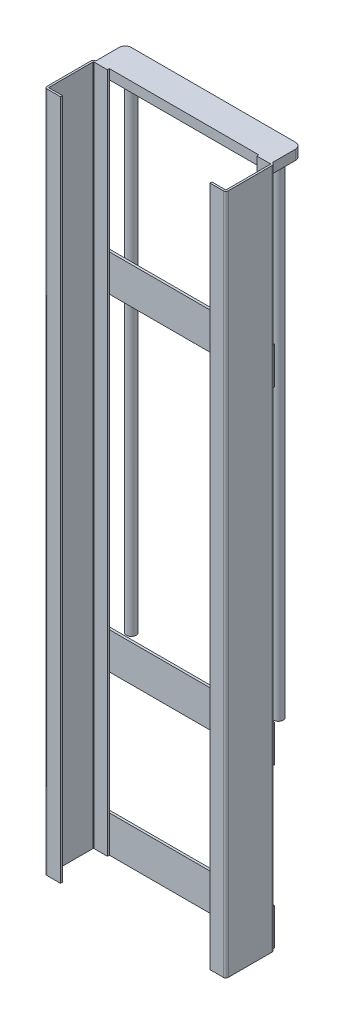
ISO-10303-21;
HEADER;
FILE_DESCRIPTION(('STEP AP214'),'2;1');
FILE_NAME('part.step','',(''),(''),'','','');
FILE_SCHEMA(('AUTOMOTIVE_DESIGN { 1 0 10303 214 1 1 1 1 }'));
ENDSEC;
DATA;
#1=APPLICATION_CONTEXT('core data for automotive mechanical design processes');
#2=APPLICATION_PROTOCOL_DEFINITION('international standard','automotive_design',2000,#1);
#3=PRODUCT_CONTEXT('',#1,'mechanical');
#4=PRODUCT('Part','Part','',(#3));
#5=PRODUCT_RELATED_PRODUCT_CATEGORY('part','',(#4));
#6=PRODUCT_DEFINITION_FORMATION('','',#4);
#7=PRODUCT_DEFINITION_CONTEXT('part definition',#1,'design');
#8=PRODUCT_DEFINITION('design','',#6,#7);
#9=PRODUCT_DEFINITION_SHAPE('','',#8);
#10=(LENGTH_UNIT() NAMED_UNIT(*) SI_UNIT(.MILLI.,.METRE.));
#11=(NAMED_UNIT(*) PLANE_ANGLE_UNIT() SI_UNIT($,.RADIAN.));
#12=(NAMED_UNIT(*) SI_UNIT($,.STERADIAN.) SOLID_ANGLE_UNIT());
#13=UNCERTAINTY_MEASURE_WITH_UNIT(LENGTH_MEASURE(1.E-05),#10,'distance_accuracy_value','');
#14=(GEOMETRIC_REPRESENTATION_CONTEXT(3) GLOBAL_UNCERTAINTY_ASSIGNED_CONTEXT((#13)) GLOBAL_UNIT_ASSIGNED_CONTEXT((#10,
#11,#12)) REPRESENTATION_CONTEXT('',''));
#15=CARTESIAN_POINT('',(0.,0.,0.));
#16=DIRECTION('',(0.,0.,1.));
#17=DIRECTION('',(1.,0.,0.));
#18=AXIS2_PLACEMENT_3D('',#15,#16,#17);
#19=CARTESIAN_POINT('',(-306.,2790.,-100.));
#20=DIRECTION('',(0.,0.,1.));
#21=DIRECTION('',(1.,0.,0.));
#22=AXIS2_PLACEMENT_3D('',#19,#20,#21);
#23=PLANE('',#22);
#24=DIRECTION('',(1.,0.,0.));
#25=VECTOR('',#24,1.);
#26=CARTESIAN_POINT('',(-361.,2750.,-100.));
#27=LINE('',#26,#25);
#28=CARTESIAN_POINT('',(-361.,2750.,-100.));
#29=VERTEX_POINT('',#28);
#30=CARTESIAN_POINT('',(-306.,2750.,-100.));
#31=VERTEX_POINT('',#30);
#32=EDGE_CURVE('E352',#29,#31,#27,.T.);
#33=ORIENTED_EDGE('',*,*,#32,.T.);
#34=DIRECTION('',(0.,-1.,0.));
#35=VECTOR('',#34,1.);
#36=CARTESIAN_POINT('',(-306.,2790.,-100.));
#37=LINE('',#36,#35);
#38=CARTESIAN_POINT('',(-306.,2140.,-100.));
#39=VERTEX_POINT('',#38);
#40=EDGE_CURVE('E40',#31,#39,#37,.T.);
#41=ORIENTED_EDGE('',*,*,#40,.T.);
#42=DIRECTION('',(1.,0.,0.));
#43=VECTOR('',#42,1.);
#44=CARTESIAN_POINT('',(361.,2140.,-100.));
#45=LINE('',#44,#43);
#46=CARTESIAN_POINT('',(-361.,2140.,-100.));
#47=VERTEX_POINT('',#46);
#48=EDGE_CURVE('E668',#47,#39,#45,.T.);
#49=ORIENTED_EDGE('',*,*,#48,.F.);
#50=DIRECTION('',(0.,-1.,0.));
#51=VECTOR('',#50,1.);
#52=CARTESIAN_POINT('',(-361.,2790.,-100.));
#53=LINE('',#52,#51);
#54=EDGE_CURVE('E515',#29,#47,#53,.T.);
#55=ORIENTED_EDGE('',*,*,#54,.F.);
#56=EDGE_LOOP('',(#33,#41,#49,#55));
#57=FACE_BOUND('',#56,.T.);
#58=ADVANCED_FACE('F32',(#57),#23,.F.);
#59=CARTESIAN_POINT('',(306.,2790.,-100.));
#60=DIRECTION('',(0.,0.,1.));
#61=DIRECTION('',(1.,0.,0.));
#62=AXIS2_PLACEMENT_3D('',#59,#60,#61);
#63=PLANE('',#62);
#64=CARTESIAN_POINT('',(306.,2750.,-100.));
#65=VERTEX_POINT('',#64);
#66=CARTESIAN_POINT('',(361.,2750.,-100.));
#67=VERTEX_POINT('',#66);
#68=EDGE_CURVE('E347',#65,#67,#27,.T.);
#69=ORIENTED_EDGE('',*,*,#68,.T.);
#70=DIRECTION('',(0.,-1.,0.));
#71=VECTOR('',#70,1.);
#72=CARTESIAN_POINT('',(361.,2790.,-100.));
#73=LINE('',#72,#71);
#74=CARTESIAN_POINT('',(361.,2140.,-100.));
#75=VERTEX_POINT('',#74);
#76=EDGE_CURVE('E339',#67,#75,#73,.T.);
#77=ORIENTED_EDGE('',*,*,#76,.T.);
#78=CARTESIAN_POINT('',(306.,2140.,-100.));
#79=VERTEX_POINT('',#78);
#80=EDGE_CURVE('E674',#79,#75,#45,.T.);
#81=ORIENTED_EDGE('',*,*,#80,.F.);
#82=DIRECTION('',(0.,-1.,0.));
#83=VECTOR('',#82,1.);
#84=CARTESIAN_POINT('',(306.,2790.,-100.));
#85=LINE('',#84,#83);
#86=EDGE_CURVE('E359',#65,#79,#85,.T.);
#87=ORIENTED_EDGE('',*,*,#86,.F.);
#88=EDGE_LOOP('',(#69,#77,#81,#87));
#89=FACE_BOUND('',#88,.T.);
#90=ADVANCED_FACE('F356',(#89),#63,.F.);
#91=DIRECTION('',(-1.,0.,0.));
#92=VECTOR('',#91,1.);
#93=CARTESIAN_POINT('',(361.,1990.,-100.));
#94=LINE('',#93,#92);
#95=CARTESIAN_POINT('',(-306.,1990.,-100.));
#96=VERTEX_POINT('',#95);
#97=CARTESIAN_POINT('',(-361.,1990.,-100.));
#98=VERTEX_POINT('',#97);
#99=EDGE_CURVE('E781',#96,#98,#94,.T.);
#100=ORIENTED_EDGE('',*,*,#99,.F.);
#101=CARTESIAN_POINT('',(-306.,800.,-100.));
#102=VERTEX_POINT('',#101);
#103=EDGE_CURVE('E519',#96,#102,#37,.T.);
#104=ORIENTED_EDGE('',*,*,#103,.T.);
#105=DIRECTION('',(1.,0.,0.));
#106=VECTOR('',#105,1.);
#107=CARTESIAN_POINT('',(361.,800.,-100.));
#108=LINE('',#107,#106);
#109=CARTESIAN_POINT('',(-361.,800.,-100.));
#110=VERTEX_POINT('',#109);
#111=EDGE_CURVE('E551',#110,#102,#108,.T.);
#112=ORIENTED_EDGE('',*,*,#111,.F.);
#113=EDGE_CURVE('E520',#98,#110,#53,.T.);
#114=ORIENTED_EDGE('',*,*,#113,.F.);
#115=EDGE_LOOP('',(#100,#104,#112,#114));
#116=FACE_BOUND('',#115,.T.);
#117=ADVANCED_FACE('F557',(#116),#23,.F.);
#118=CARTESIAN_POINT('',(361.,1990.,-100.));
#119=VERTEX_POINT('',#118);
#120=CARTESIAN_POINT('',(306.,1990.,-100.));
#121=VERTEX_POINT('',#120);
#122=EDGE_CURVE('E56',#119,#121,#94,.T.);
#123=ORIENTED_EDGE('',*,*,#122,.F.);
#124=CARTESIAN_POINT('',(361.,800.,-100.));
#125=VERTEX_POINT('',#124);
#126=EDGE_CURVE('E369',#119,#125,#73,.T.);
#127=ORIENTED_EDGE('',*,*,#126,.T.);
#128=CARTESIAN_POINT('',(306.,800.,-100.));
#129=VERTEX_POINT('',#128);
#130=EDGE_CURVE('E544',#129,#125,#108,.T.);
#131=ORIENTED_EDGE('',*,*,#130,.F.);
#132=EDGE_CURVE('E755',#121,#129,#85,.T.);
#133=ORIENTED_EDGE('',*,*,#132,.F.);
#134=EDGE_LOOP('',(#123,#127,#131,#133));
#135=FACE_BOUND('',#134,.T.);
#136=ADVANCED_FACE('F828',(#135),#63,.F.);
#137=DIRECTION('',(-1.,0.,0.));
#138=VECTOR('',#137,1.);
#139=CARTESIAN_POINT('',(361.,650.,-100.));
#140=LINE('',#139,#138);
#141=CARTESIAN_POINT('',(-306.,650.,-100.));
#142=VERTEX_POINT('',#141);
#143=CARTESIAN_POINT('',(-361.,650.,-100.));
#144=VERTEX_POINT('',#143);
#145=EDGE_CURVE('E582',#142,#144,#140,.T.);
#146=ORIENTED_EDGE('',*,*,#145,.F.);
#147=CARTESIAN_POINT('',(-306.,150.,-100.));
#148=VERTEX_POINT('',#147);
#149=EDGE_CURVE('E41',#142,#148,#37,.T.);
#150=ORIENTED_EDGE('',*,*,#149,.T.);
#151=DIRECTION('',(1.,0.,0.));
#152=VECTOR('',#151,1.);
#153=CARTESIAN_POINT('',(361.,150.,-100.));
#154=LINE('',#153,#152);
#155=CARTESIAN_POINT('',(-361.,150.,-100.));
#156=VERTEX_POINT('',#155);
#157=EDGE_CURVE('E405',#156,#148,#154,.T.);
#158=ORIENTED_EDGE('',*,*,#157,.F.);
#159=EDGE_CURVE('E512',#144,#156,#53,.T.);
#160=ORIENTED_EDGE('',*,*,#159,.F.);
#161=EDGE_LOOP('',(#146,#150,#158,#160));
#162=FACE_BOUND('',#161,.T.);
#163=ADVANCED_FACE('F601',(#162),#23,.F.);
#164=CARTESIAN_POINT('',(361.,650.,-100.));
#165=VERTEX_POINT('',#164);
#166=CARTESIAN_POINT('',(306.,650.,-100.));
#167=VERTEX_POINT('',#166);
#168=EDGE_CURVE('E545',#165,#167,#140,.T.);
#169=ORIENTED_EDGE('',*,*,#168,.F.);
#170=CARTESIAN_POINT('',(361.,150.,-100.));
#171=VERTEX_POINT('',#170);
#172=EDGE_CURVE('E341',#165,#171,#73,.T.);
#173=ORIENTED_EDGE('',*,*,#172,.T.);
#174=CARTESIAN_POINT('',(306.,150.,-100.));
#175=VERTEX_POINT('',#174);
#176=EDGE_CURVE('E419',#175,#171,#154,.T.);
#177=ORIENTED_EDGE('',*,*,#176,.F.);
#178=EDGE_CURVE('E749',#167,#175,#85,.T.);
#179=ORIENTED_EDGE('',*,*,#178,.F.);
#180=EDGE_LOOP('',(#169,#173,#177,#179));
#181=FACE_BOUND('',#180,.T.);
#182=ADVANCED_FACE('F825',(#181),#63,.F.);
#183=CARTESIAN_POINT('',(0.,0.,-100.));
#184=DIRECTION('',(0.,0.,1.));
#185=DIRECTION('',(1.,0.,0.));
#186=AXIS2_PLACEMENT_3D('',#183,#184,#185);
#187=PLANE('',#186);
#188=DIRECTION('',(-1.,0.,0.));
#189=VECTOR('',#188,1.);
#190=CARTESIAN_POINT('',(361.,0.,-100.));
#191=LINE('',#190,#189);
#192=CARTESIAN_POINT('',(306.,0.,-100.));
#193=VERTEX_POINT('',#192);
#194=CARTESIAN_POINT('',(-306.,0.,-100.));
#195=VERTEX_POINT('',#194);
#196=EDGE_CURVE('E414',#193,#195,#191,.T.);
#197=ORIENTED_EDGE('',*,*,#196,.F.);
#198=EDGE_CURVE('E612',#175,#193,#85,.T.);
#199=ORIENTED_EDGE('',*,*,#198,.F.);
#200=EDGE_CURVE('E422',#148,#175,#154,.T.);
#201=ORIENTED_EDGE('',*,*,#200,.F.);
#202=DIRECTION('',(0.,1.,0.));
#203=VECTOR('',#202,1.);
#204=CARTESIAN_POINT('',(-306.,2790.,-100.));
#205=LINE('',#204,#203);
#206=EDGE_CURVE('E434',#195,#148,#205,.T.);
#207=ORIENTED_EDGE('',*,*,#206,.F.);
#208=EDGE_LOOP('',(#197,#199,#201,#207));
#209=FACE_BOUND('',#208,.T.);
#210=ADVANCED_FACE('F611',(#209),#187,.T.);
#211=CARTESIAN_POINT('',(-306.,2790.,-100.));
#212=DIRECTION('',(-1.,0.,0.));
#213=DIRECTION('',(0.,0.,1.));
#214=AXIS2_PLACEMENT_3D('',#211,#212,#213);
#215=PLANE('',#214);
#216=DIRECTION('',(0.,0.,-1.));
#217=VECTOR('',#216,1.);
#218=CARTESIAN_POINT('',(-306.,0.,-100.));
#219=LINE('',#218,#217);
#220=CARTESIAN_POINT('',(-306.,0.,-92.));
#221=VERTEX_POINT('',#220);
#222=EDGE_CURVE('E437',#221,#195,#219,.T.);
#223=ORIENTED_EDGE('',*,*,#222,.T.);
#224=ORIENTED_EDGE('',*,*,#206,.T.);
#225=ORIENTED_EDGE('',*,*,#149,.F.);
#226=DIRECTION('',(0.,-1.,0.));
#227=VECTOR('',#226,1.);
#228=CARTESIAN_POINT('',(-306.,2790.,-100.));
#229=LINE('',#228,#227);
#230=EDGE_CURVE('E603',#102,#142,#229,.T.);
#231=ORIENTED_EDGE('',*,*,#230,.F.);
#232=ORIENTED_EDGE('',*,*,#103,.F.);
#233=DIRECTION('',(0.,-1.,0.));
#234=VECTOR('',#233,1.);
#235=CARTESIAN_POINT('',(-306.,2790.,-100.));
#236=LINE('',#235,#234);
#237=EDGE_CURVE('E583',#39,#96,#236,.T.);
#238=ORIENTED_EDGE('',*,*,#237,.F.);
#239=ORIENTED_EDGE('',*,*,#40,.F.);
#240=CARTESIAN_POINT('',(-306.,2790.,-100.));
#241=VERTEX_POINT('',#240);
#242=EDGE_CURVE('E11',#241,#31,#37,.T.);
#243=ORIENTED_EDGE('',*,*,#242,.F.);
#244=DIRECTION('',(0.,0.,-1.));
#245=VECTOR('',#244,1.);
#246=CARTESIAN_POINT('',(-306.,2790.,-100.));
#247=LINE('',#246,#245);
#248=CARTESIAN_POINT('',(-306.,2790.,-92.));
#249=VERTEX_POINT('',#248);
#250=EDGE_CURVE('E438',#249,#241,#247,.T.);
#251=ORIENTED_EDGE('',*,*,#250,.F.);
#252=DIRECTION('',(0.,-1.,0.));
#253=VECTOR('',#252,1.);
#254=CARTESIAN_POINT('',(-306.,2790.,-92.));
#255=LINE('',#254,#253);
#256=EDGE_CURVE('E462',#249,#221,#255,.T.);
#257=ORIENTED_EDGE('',*,*,#256,.T.);
#258=EDGE_LOOP('',(#223,#224,#225,#231,#232,#238,#239,#243,#251,#257));
#259=FACE_BOUND('',#258,.T.);
#260=ADVANCED_FACE('F34',(#259),#215,.F.);
#261=CARTESIAN_POINT('',(-361.,2790.,-90.));
#262=DIRECTION('',(0.,-1.,0.));
#263=DIRECTION('',(0.,0.,-1.));
#264=AXIS2_PLACEMENT_3D('',#261,#262,#263);
#265=CYLINDRICAL_SURFACE('',#264,10.);
#266=CARTESIAN_POINT('',(-361.,0.,-90.));
#267=DIRECTION('',(0.,1.,0.));
#268=DIRECTION('',(0.,0.,1.));
#269=AXIS2_PLACEMENT_3D('',#266,#267,#268);
#270=CIRCLE('',#269,10.);
#271=CARTESIAN_POINT('',(-361.,0.,-100.));
#272=VERTEX_POINT('',#271);
#273=CARTESIAN_POINT('',(-371.,0.,-90.));
#274=VERTEX_POINT('',#273);
#275=EDGE_CURVE('E465',#272,#274,#270,.T.);
#276=ORIENTED_EDGE('',*,*,#275,.T.);
#277=DIRECTION('',(0.,-1.,0.));
#278=VECTOR('',#277,1.);
#279=CARTESIAN_POINT('',(-371.,2790.,-90.));
#280=LINE('',#279,#278);
#281=CARTESIAN_POINT('',(-371.,2790.,-90.));
#282=VERTEX_POINT('',#281);
#283=EDGE_CURVE('E510',#282,#274,#280,.T.);
#284=ORIENTED_EDGE('',*,*,#283,.F.);
#285=CARTESIAN_POINT('',(-361.,2790.,-90.));
#286=DIRECTION('',(0.,1.,0.));
#287=DIRECTION('',(0.,0.,1.));
#288=AXIS2_PLACEMENT_3D('',#285,#286,#287);
#289=CIRCLE('',#288,10.);
#290=CARTESIAN_POINT('',(-361.,2790.,-100.));
#291=VERTEX_POINT('',#290);
#292=EDGE_CURVE('E441',#291,#282,#289,.T.);
#293=ORIENTED_EDGE('',*,*,#292,.F.);
#294=EDGE_CURVE('E513',#291,#29,#53,.T.);
#295=ORIENTED_EDGE('',*,*,#294,.T.);
#296=ORIENTED_EDGE('',*,*,#54,.T.);
#297=DIRECTION('',(0.,1.,0.));
#298=VECTOR('',#297,1.);
#299=CARTESIAN_POINT('',(-361.,2140.,-100.));
#300=LINE('',#299,#298);
#301=EDGE_CURVE('E530',#98,#47,#300,.T.);
#302=ORIENTED_EDGE('',*,*,#301,.F.);
#303=ORIENTED_EDGE('',*,*,#113,.T.);
#304=DIRECTION('',(0.,1.,0.));
#305=VECTOR('',#304,1.);
#306=CARTESIAN_POINT('',(-361.,800.,-100.));
#307=LINE('',#306,#305);
#308=EDGE_CURVE('E529',#144,#110,#307,.T.);
#309=ORIENTED_EDGE('',*,*,#308,.F.);
#310=ORIENTED_EDGE('',*,*,#159,.T.);
#311=DIRECTION('',(0.,1.,0.));
#312=VECTOR('',#311,1.);
#313=CARTESIAN_POINT('',(-361.,0.,-100.));
#314=LINE('',#313,#312);
#315=EDGE_CURVE('E416',#272,#156,#314,.T.);
#316=ORIENTED_EDGE('',*,*,#315,.F.);
#317=EDGE_LOOP('',(#276,#284,#293,#295,#296,#302,#303,#309,#310,#316));
#318=FACE_BOUND('',#317,.T.);
#319=ADVANCED_FACE('F528',(#318),#265,.T.);
#320=CARTESIAN_POINT('',(-371.,2790.,-90.));
#321=DIRECTION('',(1.,0.,0.));
#322=DIRECTION('',(0.,0.,-1.));
#323=AXIS2_PLACEMENT_3D('',#320,#321,#322);
#324=PLANE('',#323);
#325=DIRECTION('',(0.,0.,1.));
#326=VECTOR('',#325,1.);
#327=CARTESIAN_POINT('',(-371.,0.,-90.));
#328=LINE('',#327,#326);
#329=CARTESIAN_POINT('',(-371.,0.,90.));
#330=VERTEX_POINT('',#329);
#331=EDGE_CURVE('E467',#274,#330,#328,.T.);
#332=ORIENTED_EDGE('',*,*,#331,.T.);
#333=DIRECTION('',(0.,-1.,0.));
#334=VECTOR('',#333,1.);
#335=CARTESIAN_POINT('',(-371.,2790.,90.));
#336=LINE('',#335,#334);
#337=CARTESIAN_POINT('',(-371.,2790.,90.));
#338=VERTEX_POINT('',#337);
#339=EDGE_CURVE('E507',#338,#330,#336,.T.);
#340=ORIENTED_EDGE('',*,*,#339,.F.);
#341=DIRECTION('',(0.,0.,1.));
#342=VECTOR('',#341,1.);
#343=CARTESIAN_POINT('',(-371.,2790.,-90.));
#344=LINE('',#343,#342);
#345=EDGE_CURVE('E444',#282,#338,#344,.T.);
#346=ORIENTED_EDGE('',*,*,#345,.F.);
#347=ORIENTED_EDGE('',*,*,#283,.T.);
#348=EDGE_LOOP('',(#332,#340,#346,#347));
#349=FACE_BOUND('',#348,.T.);
#350=ADVANCED_FACE('F627',(#349),#324,.F.);
#351=CARTESIAN_POINT('',(-361.,2790.,90.));
#352=DIRECTION('',(0.,-1.,0.));
#353=DIRECTION('',(0.,0.,-1.));
#354=AXIS2_PLACEMENT_3D('',#351,#352,#353);
#355=CYLINDRICAL_SURFACE('',#354,10.);
#356=CARTESIAN_POINT('',(-361.,0.,90.));
#357=DIRECTION('',(0.,1.,0.));
#358=DIRECTION('',(0.,0.,1.));
#359=AXIS2_PLACEMENT_3D('',#356,#357,#358);
#360=CIRCLE('',#359,10.);
#361=CARTESIAN_POINT('',(-361.,0.,100.));
#362=VERTEX_POINT('',#361);
#363=EDGE_CURVE('E469',#330,#362,#360,.T.);
#364=ORIENTED_EDGE('',*,*,#363,.T.);
#365=DIRECTION('',(0.,-1.,0.));
#366=VECTOR('',#365,1.);
#367=CARTESIAN_POINT('',(-361.,2790.,100.));
#368=LINE('',#367,#366);
#369=CARTESIAN_POINT('',(-361.,2790.,100.));
#370=VERTEX_POINT('',#369);
#371=EDGE_CURVE('E504',#370,#362,#368,.T.);
#372=ORIENTED_EDGE('',*,*,#371,.F.);
#373=CARTESIAN_POINT('',(-361.,2790.,90.));
#374=DIRECTION('',(0.,1.,0.));
#375=DIRECTION('',(0.,0.,1.));
#376=AXIS2_PLACEMENT_3D('',#373,#374,#375);
#377=CIRCLE('',#376,10.);
#378=EDGE_CURVE('E446',#338,#370,#377,.T.);
#379=ORIENTED_EDGE('',*,*,#378,.F.);
#380=ORIENTED_EDGE('',*,*,#339,.T.);
#381=EDGE_LOOP('',(#364,#372,#379,#380));
#382=FACE_BOUND('',#381,.T.);
#383=ADVANCED_FACE('F635',(#382),#355,.T.);
#384=CARTESIAN_POINT('',(-361.,2790.,100.));
#385=DIRECTION('',(0.,0.,-1.));
#386=DIRECTION('',(-1.,0.,0.));
#387=AXIS2_PLACEMENT_3D('',#384,#385,#386);
#388=PLANE('',#387);
#389=DIRECTION('',(1.,0.,0.));
#390=VECTOR('',#389,1.);
#391=CARTESIAN_POINT('',(-361.,0.,100.));
#392=LINE('',#391,#390);
#393=CARTESIAN_POINT('',(-306.,0.,100.));
#394=VERTEX_POINT('',#393);
#395=EDGE_CURVE('E471',#362,#394,#392,.T.);
#396=ORIENTED_EDGE('',*,*,#395,.T.);
#397=DIRECTION('',(0.,-1.,0.));
#398=VECTOR('',#397,1.);
#399=CARTESIAN_POINT('',(-306.,2790.,100.));
#400=LINE('',#399,#398);
#401=CARTESIAN_POINT('',(-306.,2790.,100.));
#402=VERTEX_POINT('',#401);
#403=EDGE_CURVE('E501',#402,#394,#400,.T.);
#404=ORIENTED_EDGE('',*,*,#403,.F.);
#405=DIRECTION('',(1.,0.,0.));
#406=VECTOR('',#405,1.);
#407=CARTESIAN_POINT('',(-361.,2790.,100.));
#408=LINE('',#407,#406);
#409=EDGE_CURVE('E448',#370,#402,#408,.T.);
#410=ORIENTED_EDGE('',*,*,#409,.F.);
#411=ORIENTED_EDGE('',*,*,#371,.T.);
#412=EDGE_LOOP('',(#396,#404,#410,#411));
#413=FACE_BOUND('',#412,.T.);
#414=ADVANCED_FACE('F639',(#413),#388,.F.);
#415=CARTESIAN_POINT('',(-306.,2790.,92.));
#416=DIRECTION('',(-1.,0.,0.));
#417=DIRECTION('',(0.,0.,1.));
#418=AXIS2_PLACEMENT_3D('',#415,#416,#417);
#419=PLANE('',#418);
#420=DIRECTION('',(0.,0.,-1.));
#421=VECTOR('',#420,1.);
#422=CARTESIAN_POINT('',(-306.,0.,92.));
#423=LINE('',#422,#421);
#424=CARTESIAN_POINT('',(-306.,0.,92.));
#425=VERTEX_POINT('',#424);
#426=EDGE_CURVE('E473',#394,#425,#423,.T.);
#427=ORIENTED_EDGE('',*,*,#426,.T.);
#428=DIRECTION('',(0.,-1.,0.));
#429=VECTOR('',#428,1.);
#430=CARTESIAN_POINT('',(-306.,2790.,92.));
#431=LINE('',#430,#429);
#432=CARTESIAN_POINT('',(-306.,2790.,92.));
#433=VERTEX_POINT('',#432);
#434=EDGE_CURVE('E498',#433,#425,#431,.T.);
#435=ORIENTED_EDGE('',*,*,#434,.F.);
#436=DIRECTION('',(0.,0.,-1.));
#437=VECTOR('',#436,1.);
#438=CARTESIAN_POINT('',(-306.,2790.,92.));
#439=LINE('',#438,#437);
#440=EDGE_CURVE('E450',#402,#433,#439,.T.);
#441=ORIENTED_EDGE('',*,*,#440,.F.);
#442=ORIENTED_EDGE('',*,*,#403,.T.);
#443=EDGE_LOOP('',(#427,#435,#441,#442));
#444=FACE_BOUND('',#443,.T.);
#445=ADVANCED_FACE('F1304',(#444),#419,.F.);
#446=CARTESIAN_POINT('',(-361.,2790.,92.));
#447=DIRECTION('',(0.,0.,1.));
#448=DIRECTION('',(1.,0.,0.));
#449=AXIS2_PLACEMENT_3D('',#446,#447,#448);
#450=PLANE('',#449);
#451=DIRECTION('',(-1.,0.,0.));
#452=VECTOR('',#451,1.);
#453=CARTESIAN_POINT('',(-361.,0.,92.));
#454=LINE('',#453,#452);
#455=CARTESIAN_POINT('',(-361.,0.,92.));
#456=VERTEX_POINT('',#455);
#457=EDGE_CURVE('E475',#425,#456,#454,.T.);
#458=ORIENTED_EDGE('',*,*,#457,.T.);
#459=DIRECTION('',(0.,-1.,0.));
#460=VECTOR('',#459,1.);
#461=CARTESIAN_POINT('',(-361.,2790.,92.));
#462=LINE('',#461,#460);
#463=CARTESIAN_POINT('',(-361.,2790.,92.));
#464=VERTEX_POINT('',#463);
#465=EDGE_CURVE('E495',#464,#456,#462,.T.);
#466=ORIENTED_EDGE('',*,*,#465,.F.);
#467=DIRECTION('',(-1.,0.,0.));
#468=VECTOR('',#467,1.);
#469=CARTESIAN_POINT('',(-361.,2790.,92.));
#470=LINE('',#469,#468);
#471=EDGE_CURVE('E452',#433,#464,#470,.T.);
#472=ORIENTED_EDGE('',*,*,#471,.F.);
#473=ORIENTED_EDGE('',*,*,#434,.T.);
#474=EDGE_LOOP('',(#458,#466,#472,#473));
#475=FACE_BOUND('',#474,.T.);
#476=ADVANCED_FACE('F1296',(#475),#450,.F.);
#477=CARTESIAN_POINT('',(-361.,2790.,90.));
#478=DIRECTION('',(0.,-1.,0.));
#479=DIRECTION('',(0.,0.,-1.));
#480=AXIS2_PLACEMENT_3D('',#477,#478,#479);
#481=CYLINDRICAL_SURFACE('',#480,2.);
#482=CARTESIAN_POINT('',(-361.,0.,90.));
#483=DIRECTION('',(0.,-1.,0.));
#484=DIRECTION('',(0.,0.,1.));
#485=AXIS2_PLACEMENT_3D('',#482,#483,#484);
#486=CIRCLE('',#485,2.);
#487=CARTESIAN_POINT('',(-363.,0.,90.));
#488=VERTEX_POINT('',#487);
#489=EDGE_CURVE('E477',#456,#488,#486,.T.);
#490=ORIENTED_EDGE('',*,*,#489,.T.);
#491=DIRECTION('',(0.,-1.,0.));
#492=VECTOR('',#491,1.);
#493=CARTESIAN_POINT('',(-363.,2790.,90.));
#494=LINE('',#493,#492);
#495=CARTESIAN_POINT('',(-363.,2790.,90.));
#496=VERTEX_POINT('',#495);
#497=EDGE_CURVE('E492',#496,#488,#494,.T.);
#498=ORIENTED_EDGE('',*,*,#497,.F.);
#499=CARTESIAN_POINT('',(-361.,2790.,90.));
#500=DIRECTION('',(0.,-1.,0.));
#501=DIRECTION('',(0.,0.,1.));
#502=AXIS2_PLACEMENT_3D('',#499,#500,#501);
#503=CIRCLE('',#502,2.);
#504=EDGE_CURVE('E454',#464,#496,#503,.T.);
#505=ORIENTED_EDGE('',*,*,#504,.F.);
#506=ORIENTED_EDGE('',*,*,#465,.T.);
#507=EDGE_LOOP('',(#490,#498,#505,#506));
#508=FACE_BOUND('',#507,.T.);
#509=ADVANCED_FACE('F1288',(#508),#481,.F.);
#510=CARTESIAN_POINT('',(-363.,2790.,-90.));
#511=DIRECTION('',(-1.,0.,0.));
#512=DIRECTION('',(0.,0.,1.));
#513=AXIS2_PLACEMENT_3D('',#510,#511,#512);
#514=PLANE('',#513);
#515=DIRECTION('',(0.,0.,-1.));
#516=VECTOR('',#515,1.);
#517=CARTESIAN_POINT('',(-363.,0.,-90.));
#518=LINE('',#517,#516);
#519=CARTESIAN_POINT('',(-363.,0.,-90.));
#520=VERTEX_POINT('',#519);
#521=EDGE_CURVE('E479',#488,#520,#518,.T.);
#522=ORIENTED_EDGE('',*,*,#521,.T.);
#523=DIRECTION('',(0.,-1.,0.));
#524=VECTOR('',#523,1.);
#525=CARTESIAN_POINT('',(-363.,2790.,-90.));
#526=LINE('',#525,#524);
#527=CARTESIAN_POINT('',(-363.,2790.,-90.));
#528=VERTEX_POINT('',#527);
#529=EDGE_CURVE('E489',#528,#520,#526,.T.);
#530=ORIENTED_EDGE('',*,*,#529,.F.);
#531=DIRECTION('',(0.,0.,-1.));
#532=VECTOR('',#531,1.);
#533=CARTESIAN_POINT('',(-363.,2790.,-90.));
#534=LINE('',#533,#532);
#535=EDGE_CURVE('E456',#496,#528,#534,.T.);
#536=ORIENTED_EDGE('',*,*,#535,.F.);
#537=ORIENTED_EDGE('',*,*,#497,.T.);
#538=EDGE_LOOP('',(#522,#530,#536,#537));
#539=FACE_BOUND('',#538,.T.);
#540=ADVANCED_FACE('F1280',(#539),#514,.F.);
#541=CARTESIAN_POINT('',(-361.,2790.,-90.));
#542=DIRECTION('',(0.,-1.,0.));
#543=DIRECTION('',(0.,0.,-1.));
#544=AXIS2_PLACEMENT_3D('',#541,#542,#543);
#545=CYLINDRICAL_SURFACE('',#544,1.99999999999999);
#546=CARTESIAN_POINT('',(-361.,0.,-90.));
#547=DIRECTION('',(0.,-1.,0.));
#548=DIRECTION('',(0.,0.,1.));
#549=AXIS2_PLACEMENT_3D('',#546,#547,#548);
#550=CIRCLE('',#549,1.99999999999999);
#551=CARTESIAN_POINT('',(-361.,0.,-92.));
#552=VERTEX_POINT('',#551);
#553=EDGE_CURVE('E481',#520,#552,#550,.T.);
#554=ORIENTED_EDGE('',*,*,#553,.T.);
#555=DIRECTION('',(0.,-1.,0.));
#556=VECTOR('',#555,1.);
#557=CARTESIAN_POINT('',(-361.,2790.,-92.));
#558=LINE('',#557,#556);
#559=CARTESIAN_POINT('',(-361.,2790.,-92.));
#560=VERTEX_POINT('',#559);
#561=EDGE_CURVE('E486',#560,#552,#558,.T.);
#562=ORIENTED_EDGE('',*,*,#561,.F.);
#563=CARTESIAN_POINT('',(-361.,2790.,-90.));
#564=DIRECTION('',(0.,-1.,0.));
#565=DIRECTION('',(0.,0.,1.));
#566=AXIS2_PLACEMENT_3D('',#563,#564,#565);
#567=CIRCLE('',#566,1.99999999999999);
#568=EDGE_CURVE('E458',#528,#560,#567,.T.);
#569=ORIENTED_EDGE('',*,*,#568,.F.);
#570=ORIENTED_EDGE('',*,*,#529,.T.);
#571=EDGE_LOOP('',(#554,#562,#569,#570));
#572=FACE_BOUND('',#571,.T.);
#573=ADVANCED_FACE('F1272',(#572),#545,.F.);
#574=CARTESIAN_POINT('',(-306.,2790.,-92.));
#575=DIRECTION('',(0.,0.,-1.));
#576=DIRECTION('',(-1.,0.,0.));
#577=AXIS2_PLACEMENT_3D('',#574,#575,#576);
#578=PLANE('',#577);
#579=DIRECTION('',(1.,0.,0.));
#580=VECTOR('',#579,1.);
#581=CARTESIAN_POINT('',(-306.,0.,-92.));
#582=LINE('',#581,#580);
#583=EDGE_CURVE('E442',#552,#221,#582,.T.);
#584=ORIENTED_EDGE('',*,*,#583,.T.);
#585=ORIENTED_EDGE('',*,*,#256,.F.);
#586=DIRECTION('',(1.,0.,0.));
#587=VECTOR('',#586,1.);
#588=CARTESIAN_POINT('',(-306.,2790.,-92.));
#589=LINE('',#588,#587);
#590=EDGE_CURVE('E460',#560,#249,#589,.T.);
#591=ORIENTED_EDGE('',*,*,#590,.F.);
#592=ORIENTED_EDGE('',*,*,#561,.T.);
#593=EDGE_LOOP('',(#584,#585,#591,#592));
#594=FACE_BOUND('',#593,.T.);
#595=ADVANCED_FACE('F1211',(#594),#578,.F.);
#596=CARTESIAN_POINT('',(-361.,2790.,-90.));
#597=DIRECTION('',(0.,1.,0.));
#598=DIRECTION('',(0.,0.,1.));
#599=AXIS2_PLACEMENT_3D('',#596,#597,#598);
#600=PLANE('',#599);
#601=ORIENTED_EDGE('',*,*,#250,.T.);
#602=DIRECTION('',(1.,0.,0.));
#603=VECTOR('',#602,1.);
#604=CARTESIAN_POINT('',(-361.,2790.,-100.));
#605=LINE('',#604,#603);
#606=CARTESIAN_POINT('',(306.,2790.,-100.));
#607=VERTEX_POINT('',#606);
#608=EDGE_CURVE('E787',#241,#607,#605,.T.);
#609=ORIENTED_EDGE('',*,*,#608,.T.);
#610=DIRECTION('',(0.,0.,1.));
#611=VECTOR('',#610,1.);
#612=CARTESIAN_POINT('',(306.,2790.,-100.));
#613=LINE('',#612,#611);
#614=CARTESIAN_POINT('',(306.,2790.,-92.));
#615=VERTEX_POINT('',#614);
#616=EDGE_CURVE('E721',#607,#615,#613,.T.);
#617=ORIENTED_EDGE('',*,*,#616,.T.);
#618=DIRECTION('',(1.,0.,0.));
#619=VECTOR('',#618,1.);
#620=CARTESIAN_POINT('',(306.,2790.,-92.));
#621=LINE('',#620,#619);
#622=CARTESIAN_POINT('',(361.,2790.,-92.));
#623=VERTEX_POINT('',#622);
#624=EDGE_CURVE('E699',#615,#623,#621,.T.);
#625=ORIENTED_EDGE('',*,*,#624,.T.);
#626=CARTESIAN_POINT('',(361.,2790.,-90.));
#627=DIRECTION('',(0.,-1.,0.));
#628=DIRECTION('',(0.,0.,-1.));
#629=AXIS2_PLACEMENT_3D('',#626,#627,#628);
#630=CIRCLE('',#629,1.99999999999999);
#631=CARTESIAN_POINT('',(363.,2790.,-90.));
#632=VERTEX_POINT('',#631);
#633=EDGE_CURVE('E702',#623,#632,#630,.T.);
#634=ORIENTED_EDGE('',*,*,#633,.T.);
#635=DIRECTION('',(0.,0.,1.));
#636=VECTOR('',#635,1.);
#637=CARTESIAN_POINT('',(363.,2790.,-90.));
#638=LINE('',#637,#636);
#639=CARTESIAN_POINT('',(363.,2790.,90.));
#640=VERTEX_POINT('',#639);
#641=EDGE_CURVE('E705',#632,#640,#638,.T.);
#642=ORIENTED_EDGE('',*,*,#641,.T.);
#643=CARTESIAN_POINT('',(361.,2790.,90.));
#644=DIRECTION('',(0.,-1.,0.));
#645=DIRECTION('',(0.,0.,-1.));
#646=AXIS2_PLACEMENT_3D('',#643,#644,#645);
#647=CIRCLE('',#646,2.);
#648=CARTESIAN_POINT('',(361.,2790.,92.));
#649=VERTEX_POINT('',#648);
#650=EDGE_CURVE('E707',#640,#649,#647,.T.);
#651=ORIENTED_EDGE('',*,*,#650,.T.);
#652=DIRECTION('',(-1.,0.,0.));
#653=VECTOR('',#652,1.);
#654=CARTESIAN_POINT('',(361.,2790.,92.));
#655=LINE('',#654,#653);
#656=CARTESIAN_POINT('',(306.,2790.,92.));
#657=VERTEX_POINT('',#656);
#658=EDGE_CURVE('E709',#649,#657,#655,.T.);
#659=ORIENTED_EDGE('',*,*,#658,.T.);
#660=DIRECTION('',(0.,0.,1.));
#661=VECTOR('',#660,1.);
#662=CARTESIAN_POINT('',(306.,2790.,92.));
#663=LINE('',#662,#661);
#664=CARTESIAN_POINT('',(306.,2790.,100.));
#665=VERTEX_POINT('',#664);
#666=EDGE_CURVE('E711',#657,#665,#663,.T.);
#667=ORIENTED_EDGE('',*,*,#666,.T.);
#668=DIRECTION('',(1.,0.,0.));
#669=VECTOR('',#668,1.);
#670=CARTESIAN_POINT('',(361.,2790.,100.));
#671=LINE('',#670,#669);
#672=CARTESIAN_POINT('',(361.,2790.,100.));
#673=VERTEX_POINT('',#672);
#674=EDGE_CURVE('E713',#665,#673,#671,.T.);
#675=ORIENTED_EDGE('',*,*,#674,.T.);
#676=CARTESIAN_POINT('',(361.,2790.,90.));
#677=DIRECTION('',(0.,1.,0.));
#678=DIRECTION('',(0.,0.,-1.));
#679=AXIS2_PLACEMENT_3D('',#676,#677,#678);
#680=CIRCLE('',#679,10.);
#681=CARTESIAN_POINT('',(371.,2790.,90.));
#682=VERTEX_POINT('',#681);
#683=EDGE_CURVE('E715',#673,#682,#680,.T.);
#684=ORIENTED_EDGE('',*,*,#683,.T.);
#685=DIRECTION('',(0.,0.,-1.));
#686=VECTOR('',#685,1.);
#687=CARTESIAN_POINT('',(371.,2790.,-90.));
#688=LINE('',#687,#686);
#689=CARTESIAN_POINT('',(371.,2790.,-90.));
#690=VERTEX_POINT('',#689);
#691=EDGE_CURVE('E717',#682,#690,#688,.T.);
#692=ORIENTED_EDGE('',*,*,#691,.T.);
#693=CARTESIAN_POINT('',(361.,2790.,-90.));
#694=DIRECTION('',(0.,1.,0.));
#695=DIRECTION('',(0.,0.,-1.));
#696=AXIS2_PLACEMENT_3D('',#693,#694,#695);
#697=CIRCLE('',#696,10.);
#698=CARTESIAN_POINT('',(361.,2790.,-100.));
#699=VERTEX_POINT('',#698);
#700=EDGE_CURVE('E719',#690,#699,#697,.T.);
#701=ORIENTED_EDGE('',*,*,#700,.T.);
#702=DIRECTION('',(0.,0.,-1.));
#703=VECTOR('',#702,1.);
#704=CARTESIAN_POINT('',(361.,2790.,-100.));
#705=LINE('',#704,#703);
#706=CARTESIAN_POINT('',(361.,2790.,-195.));
#707=VERTEX_POINT('',#706);
#708=EDGE_CURVE('E333',#699,#707,#705,.T.);
#709=ORIENTED_EDGE('',*,*,#708,.T.);
#710=CARTESIAN_POINT('',(336.,2790.,-195.));
#711=DIRECTION('',(0.,1.,0.));
#712=DIRECTION('',(0.,0.,1.));
#713=AXIS2_PLACEMENT_3D('',#710,#711,#712);
#714=CIRCLE('',#713,25.);
#715=CARTESIAN_POINT('',(336.,2790.,-220.));
#716=VERTEX_POINT('',#715);
#717=EDGE_CURVE('E799',#707,#716,#714,.T.);
#718=ORIENTED_EDGE('',*,*,#717,.T.);
#719=DIRECTION('',(-1.,0.,0.));
#720=VECTOR('',#719,1.);
#721=CARTESIAN_POINT('',(336.,2790.,-220.));
#722=LINE('',#721,#720);
#723=CARTESIAN_POINT('',(-336.,2790.,-220.));
#724=VERTEX_POINT('',#723);
#725=EDGE_CURVE('E802',#716,#724,#722,.T.);
#726=ORIENTED_EDGE('',*,*,#725,.T.);
#727=CARTESIAN_POINT('',(-336.,2790.,-195.));
#728=DIRECTION('',(0.,1.,0.));
#729=DIRECTION('',(0.,0.,1.));
#730=AXIS2_PLACEMENT_3D('',#727,#728,#729);
#731=CIRCLE('',#730,25.);
#732=CARTESIAN_POINT('',(-361.,2790.,-195.));
#733=VERTEX_POINT('',#732);
#734=EDGE_CURVE('E649',#724,#733,#731,.T.);
#735=ORIENTED_EDGE('',*,*,#734,.T.);
#736=DIRECTION('',(0.,0.,1.));
#737=VECTOR('',#736,1.);
#738=CARTESIAN_POINT('',(-361.,2790.,-195.));
#739=LINE('',#738,#737);
#740=EDGE_CURVE('E362',#733,#291,#739,.T.);
#741=ORIENTED_EDGE('',*,*,#740,.T.);
#742=ORIENTED_EDGE('',*,*,#292,.T.);
#743=ORIENTED_EDGE('',*,*,#345,.T.);
#744=ORIENTED_EDGE('',*,*,#378,.T.);
#745=ORIENTED_EDGE('',*,*,#409,.T.);
#746=ORIENTED_EDGE('',*,*,#440,.T.);
#747=ORIENTED_EDGE('',*,*,#471,.T.);
#748=ORIENTED_EDGE('',*,*,#504,.T.);
#749=ORIENTED_EDGE('',*,*,#535,.T.);
#750=ORIENTED_EDGE('',*,*,#568,.T.);
#751=ORIENTED_EDGE('',*,*,#590,.T.);
#752=EDGE_LOOP('',(#601,#609,#617,#625,#634,#642,#651,#659,#667,#675,#684,#692,#701,#709,#718,
#726,#735,#741,#742,#743,#744,#745,#746,#747,#748,#749,#750,#751));
#753=FACE_BOUND('',#752,.T.);
#754=ADVANCED_FACE('F643',(#753),#600,.T.);
#755=CARTESIAN_POINT('',(-361.,0.,-90.));
#756=DIRECTION('',(0.,1.,0.));
#757=DIRECTION('',(0.,0.,1.));
#758=AXIS2_PLACEMENT_3D('',#755,#756,#757);
#759=PLANE('',#758);
#760=ORIENTED_EDGE('',*,*,#222,.F.);
#761=ORIENTED_EDGE('',*,*,#583,.F.);
#762=ORIENTED_EDGE('',*,*,#553,.F.);
#763=ORIENTED_EDGE('',*,*,#521,.F.);
#764=ORIENTED_EDGE('',*,*,#489,.F.);
#765=ORIENTED_EDGE('',*,*,#457,.F.);
#766=ORIENTED_EDGE('',*,*,#426,.F.);
#767=ORIENTED_EDGE('',*,*,#395,.F.);
#768=ORIENTED_EDGE('',*,*,#363,.F.);
#769=ORIENTED_EDGE('',*,*,#331,.F.);
#770=ORIENTED_EDGE('',*,*,#275,.F.);
#771=DIRECTION('',(0.,0.,1.));
#772=VECTOR('',#771,1.);
#773=CARTESIAN_POINT('',(-361.,0.,-110.));
#774=LINE('',#773,#772);
#775=CARTESIAN_POINT('',(-361.,0.,-110.));
#776=VERTEX_POINT('',#775);
#777=EDGE_CURVE('E428',#776,#272,#774,.T.);
#778=ORIENTED_EDGE('',*,*,#777,.F.);
#779=DIRECTION('',(-1.,0.,0.));
#780=VECTOR('',#779,1.);
#781=CARTESIAN_POINT('',(361.,0.,-110.));
#782=LINE('',#781,#780);
#783=CARTESIAN_POINT('',(361.,0.,-110.));
#784=VERTEX_POINT('',#783);
#785=EDGE_CURVE('E404',#784,#776,#782,.T.);
#786=ORIENTED_EDGE('',*,*,#785,.F.);
#787=DIRECTION('',(0.,0.,1.));
#788=VECTOR('',#787,1.);
#789=CARTESIAN_POINT('',(361.,0.,-110.));
#790=LINE('',#789,#788);
#791=CARTESIAN_POINT('',(361.,0.,-100.));
#792=VERTEX_POINT('',#791);
#793=EDGE_CURVE('E431',#784,#792,#790,.T.);
#794=ORIENTED_EDGE('',*,*,#793,.T.);
#795=CARTESIAN_POINT('',(361.,0.,-90.));
#796=DIRECTION('',(0.,1.,0.));
#797=DIRECTION('',(0.,0.,-1.));
#798=AXIS2_PLACEMENT_3D('',#795,#796,#797);
#799=CIRCLE('',#798,10.);
#800=CARTESIAN_POINT('',(371.,0.,-90.));
#801=VERTEX_POINT('',#800);
#802=EDGE_CURVE('E742',#801,#792,#799,.T.);
#803=ORIENTED_EDGE('',*,*,#802,.F.);
#804=DIRECTION('',(0.,0.,-1.));
#805=VECTOR('',#804,1.);
#806=CARTESIAN_POINT('',(371.,0.,-90.));
#807=LINE('',#806,#805);
#808=CARTESIAN_POINT('',(371.,0.,90.));
#809=VERTEX_POINT('',#808);
#810=EDGE_CURVE('E740',#809,#801,#807,.T.);
#811=ORIENTED_EDGE('',*,*,#810,.F.);
#812=CARTESIAN_POINT('',(361.,0.,90.));
#813=DIRECTION('',(0.,1.,0.));
#814=DIRECTION('',(0.,0.,-1.));
#815=AXIS2_PLACEMENT_3D('',#812,#813,#814);
#816=CIRCLE('',#815,10.);
#817=CARTESIAN_POINT('',(361.,0.,100.));
#818=VERTEX_POINT('',#817);
#819=EDGE_CURVE('E738',#818,#809,#816,.T.);
#820=ORIENTED_EDGE('',*,*,#819,.F.);
#821=DIRECTION('',(1.,0.,0.));
#822=VECTOR('',#821,1.);
#823=CARTESIAN_POINT('',(361.,0.,100.));
#824=LINE('',#823,#822);
#825=CARTESIAN_POINT('',(306.,0.,100.));
#826=VERTEX_POINT('',#825);
#827=EDGE_CURVE('E736',#826,#818,#824,.T.);
#828=ORIENTED_EDGE('',*,*,#827,.F.);
#829=DIRECTION('',(0.,0.,1.));
#830=VECTOR('',#829,1.);
#831=CARTESIAN_POINT('',(306.,0.,92.));
#832=LINE('',#831,#830);
#833=CARTESIAN_POINT('',(306.,0.,92.));
#834=VERTEX_POINT('',#833);
#835=EDGE_CURVE('E734',#834,#826,#832,.T.);
#836=ORIENTED_EDGE('',*,*,#835,.F.);
#837=DIRECTION('',(-1.,0.,0.));
#838=VECTOR('',#837,1.);
#839=CARTESIAN_POINT('',(361.,0.,92.));
#840=LINE('',#839,#838);
#841=CARTESIAN_POINT('',(361.,0.,92.));
#842=VERTEX_POINT('',#841);
#843=EDGE_CURVE('E732',#842,#834,#840,.T.);
#844=ORIENTED_EDGE('',*,*,#843,.F.);
#845=CARTESIAN_POINT('',(361.,0.,90.));
#846=DIRECTION('',(0.,-1.,0.));
#847=DIRECTION('',(0.,0.,-1.));
#848=AXIS2_PLACEMENT_3D('',#845,#846,#847);
#849=CIRCLE('',#848,2.);
#850=CARTESIAN_POINT('',(363.,0.,90.));
#851=VERTEX_POINT('',#850);
#852=EDGE_CURVE('E730',#851,#842,#849,.T.);
#853=ORIENTED_EDGE('',*,*,#852,.F.);
#854=DIRECTION('',(0.,0.,1.));
#855=VECTOR('',#854,1.);
#856=CARTESIAN_POINT('',(363.,0.,-90.));
#857=LINE('',#856,#855);
#858=CARTESIAN_POINT('',(363.,0.,-90.));
#859=VERTEX_POINT('',#858);
#860=EDGE_CURVE('E728',#859,#851,#857,.T.);
#861=ORIENTED_EDGE('',*,*,#860,.F.);
#862=CARTESIAN_POINT('',(361.,0.,-90.));
#863=DIRECTION('',(0.,-1.,0.));
#864=DIRECTION('',(0.,0.,-1.));
#865=AXIS2_PLACEMENT_3D('',#862,#863,#864);
#866=CIRCLE('',#865,1.99999999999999);
#867=CARTESIAN_POINT('',(361.,0.,-92.));
#868=VERTEX_POINT('',#867);
#869=EDGE_CURVE('E726',#868,#859,#866,.T.);
#870=ORIENTED_EDGE('',*,*,#869,.F.);
#871=DIRECTION('',(1.,0.,0.));
#872=VECTOR('',#871,1.);
#873=CARTESIAN_POINT('',(306.,0.,-92.));
#874=LINE('',#873,#872);
#875=CARTESIAN_POINT('',(306.,0.,-92.));
#876=VERTEX_POINT('',#875);
#877=EDGE_CURVE('E695',#876,#868,#874,.T.);
#878=ORIENTED_EDGE('',*,*,#877,.F.);
#879=DIRECTION('',(0.,0.,1.));
#880=VECTOR('',#879,1.);
#881=CARTESIAN_POINT('',(306.,0.,-100.));
#882=LINE('',#881,#880);
#883=EDGE_CURVE('E703',#193,#876,#882,.T.);
#884=ORIENTED_EDGE('',*,*,#883,.F.);
#885=ORIENTED_EDGE('',*,*,#196,.T.);
#886=EDGE_LOOP('',(#760,#761,#762,#763,#764,#765,#766,#767,#768,#769,#770,#778,#786,#794,#803,
#811,#820,#828,#836,#844,#853,#861,#870,#878,#884,#885));
#887=FACE_BOUND('',#886,.T.);
#888=ADVANCED_FACE('F630',(#887),#759,.F.);
#889=CARTESIAN_POINT('',(361.,0.,-110.));
#890=DIRECTION('',(-1.,0.,0.));
#891=DIRECTION('',(0.,0.,1.));
#892=AXIS2_PLACEMENT_3D('',#889,#890,#891);
#893=PLANE('',#892);
#894=DIRECTION('',(0.,-1.,0.));
#895=VECTOR('',#894,1.);
#896=CARTESIAN_POINT('',(361.,0.,-100.));
#897=LINE('',#896,#895);
#898=EDGE_CURVE('E400',#171,#792,#897,.T.);
#899=ORIENTED_EDGE('',*,*,#898,.T.);
#900=ORIENTED_EDGE('',*,*,#793,.F.);
#901=DIRECTION('',(0.,-1.,0.));
#902=VECTOR('',#901,1.);
#903=CARTESIAN_POINT('',(361.,0.,-110.));
#904=LINE('',#903,#902);
#905=CARTESIAN_POINT('',(361.,150.,-110.));
#906=VERTEX_POINT('',#905);
#907=EDGE_CURVE('E401',#906,#784,#904,.T.);
#908=ORIENTED_EDGE('',*,*,#907,.F.);
#909=DIRECTION('',(0.,0.,1.));
#910=VECTOR('',#909,1.);
#911=CARTESIAN_POINT('',(361.,150.,-110.));
#912=LINE('',#911,#910);
#913=EDGE_CURVE('E411',#906,#171,#912,.T.);
#914=ORIENTED_EDGE('',*,*,#913,.T.);
#915=EDGE_LOOP('',(#899,#900,#908,#914));
#916=FACE_BOUND('',#915,.T.);
#917=ADVANCED_FACE('F821',(#916),#893,.F.);
#918=CARTESIAN_POINT('',(-361.,0.,-110.));
#919=DIRECTION('',(1.,0.,0.));
#920=DIRECTION('',(0.,0.,-1.));
#921=AXIS2_PLACEMENT_3D('',#918,#919,#920);
#922=PLANE('',#921);
#923=ORIENTED_EDGE('',*,*,#315,.T.);
#924=DIRECTION('',(0.,0.,1.));
#925=VECTOR('',#924,1.);
#926=CARTESIAN_POINT('',(-361.,150.,-110.));
#927=LINE('',#926,#925);
#928=CARTESIAN_POINT('',(-361.,150.,-110.));
#929=VERTEX_POINT('',#928);
#930=EDGE_CURVE('E425',#929,#156,#927,.T.);
#931=ORIENTED_EDGE('',*,*,#930,.F.);
#932=DIRECTION('',(0.,1.,0.));
#933=VECTOR('',#932,1.);
#934=CARTESIAN_POINT('',(-361.,0.,-110.));
#935=LINE('',#934,#933);
#936=EDGE_CURVE('E407',#776,#929,#935,.T.);
#937=ORIENTED_EDGE('',*,*,#936,.F.);
#938=ORIENTED_EDGE('',*,*,#777,.T.);
#939=EDGE_LOOP('',(#923,#931,#937,#938));
#940=FACE_BOUND('',#939,.T.);
#941=ADVANCED_FACE('F619',(#940),#922,.F.);
#942=CARTESIAN_POINT('',(361.,150.,-110.));
#943=DIRECTION('',(0.,-1.,0.));
#944=DIRECTION('',(0.,0.,-1.));
#945=AXIS2_PLACEMENT_3D('',#942,#943,#944);
#946=PLANE('',#945);
#947=ORIENTED_EDGE('',*,*,#157,.T.);
#948=ORIENTED_EDGE('',*,*,#200,.T.);
#949=ORIENTED_EDGE('',*,*,#176,.T.);
#950=ORIENTED_EDGE('',*,*,#913,.F.);
#951=DIRECTION('',(1.,0.,0.));
#952=VECTOR('',#951,1.);
#953=CARTESIAN_POINT('',(361.,150.,-110.));
#954=LINE('',#953,#952);
#955=EDGE_CURVE('E409',#929,#906,#954,.T.);
#956=ORIENTED_EDGE('',*,*,#955,.F.);
#957=ORIENTED_EDGE('',*,*,#930,.T.);
#958=EDGE_LOOP('',(#947,#948,#949,#950,#956,#957));
#959=FACE_BOUND('',#958,.T.);
#960=ADVANCED_FACE('F615',(#959),#946,.F.);
#961=CARTESIAN_POINT('',(0.,0.,-110.));
#962=DIRECTION('',(0.,0.,1.));
#963=DIRECTION('',(1.,0.,0.));
#964=AXIS2_PLACEMENT_3D('',#961,#962,#963);
#965=PLANE('',#964);
#966=ORIENTED_EDGE('',*,*,#907,.T.);
#967=ORIENTED_EDGE('',*,*,#785,.T.);
#968=ORIENTED_EDGE('',*,*,#936,.T.);
#969=ORIENTED_EDGE('',*,*,#955,.T.);
#970=EDGE_LOOP('',(#966,#967,#968,#969));
#971=FACE_BOUND('',#970,.T.);
#972=ADVANCED_FACE('F902',(#971),#965,.F.);
#973=CARTESIAN_POINT('',(306.,2790.,-92.));
#974=DIRECTION('',(0.,0.,-1.));
#975=DIRECTION('',(-1.,0.,0.));
#976=AXIS2_PLACEMENT_3D('',#973,#974,#975);
#977=PLANE('',#976);
#978=ORIENTED_EDGE('',*,*,#877,.T.);
#979=DIRECTION('',(0.,-1.,0.));
#980=VECTOR('',#979,1.);
#981=CARTESIAN_POINT('',(361.,2790.,-92.));
#982=LINE('',#981,#980);
#983=EDGE_CURVE('E397',#623,#868,#982,.T.);
#984=ORIENTED_EDGE('',*,*,#983,.F.);
#985=ORIENTED_EDGE('',*,*,#624,.F.);
#986=DIRECTION('',(0.,-1.,0.));
#987=VECTOR('',#986,1.);
#988=CARTESIAN_POINT('',(306.,2790.,-92.));
#989=LINE('',#988,#987);
#990=EDGE_CURVE('E723',#615,#876,#989,.T.);
#991=ORIENTED_EDGE('',*,*,#990,.T.);
#992=EDGE_LOOP('',(#978,#984,#985,#991));
#993=FACE_BOUND('',#992,.T.);
#994=ADVANCED_FACE('F911',(#993),#977,.F.);
#995=CARTESIAN_POINT('',(361.,2790.,-90.));
#996=DIRECTION('',(0.,-1.,0.));
#997=DIRECTION('',(0.,0.,-1.));
#998=AXIS2_PLACEMENT_3D('',#995,#996,#997);
#999=CYLINDRICAL_SURFACE('',#998,1.99999999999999);
#1000=ORIENTED_EDGE('',*,*,#869,.T.);
#1001=DIRECTION('',(0.,-1.,0.));
#1002=VECTOR('',#1001,1.);
#1003=CARTESIAN_POINT('',(363.,2790.,-90.));
#1004=LINE('',#1003,#1002);
#1005=EDGE_CURVE('E394',#632,#859,#1004,.T.);
#1006=ORIENTED_EDGE('',*,*,#1005,.F.);
#1007=ORIENTED_EDGE('',*,*,#633,.F.);
#1008=ORIENTED_EDGE('',*,*,#983,.T.);
#1009=EDGE_LOOP('',(#1000,#1006,#1007,#1008));
#1010=FACE_BOUND('',#1009,.T.);
#1011=ADVANCED_FACE('F922',(#1010),#999,.F.);
#1012=CARTESIAN_POINT('',(363.,2790.,-90.));
#1013=DIRECTION('',(1.,0.,0.));
#1014=DIRECTION('',(0.,0.,-1.));
#1015=AXIS2_PLACEMENT_3D('',#1012,#1013,#1014);
#1016=PLANE('',#1015);
#1017=ORIENTED_EDGE('',*,*,#860,.T.);
#1018=DIRECTION('',(0.,-1.,0.));
#1019=VECTOR('',#1018,1.);
#1020=CARTESIAN_POINT('',(363.,2790.,90.));
#1021=LINE('',#1020,#1019);
#1022=EDGE_CURVE('E391',#640,#851,#1021,.T.);
#1023=ORIENTED_EDGE('',*,*,#1022,.F.);
#1024=ORIENTED_EDGE('',*,*,#641,.F.);
#1025=ORIENTED_EDGE('',*,*,#1005,.T.);
#1026=EDGE_LOOP('',(#1017,#1023,#1024,#1025));
#1027=FACE_BOUND('',#1026,.T.);
#1028=ADVANCED_FACE('F932',(#1027),#1016,.F.);
#1029=CARTESIAN_POINT('',(361.,2790.,90.));
#1030=DIRECTION('',(0.,-1.,0.));
#1031=DIRECTION('',(0.,0.,-1.));
#1032=AXIS2_PLACEMENT_3D('',#1029,#1030,#1031);
#1033=CYLINDRICAL_SURFACE('',#1032,2.);
#1034=ORIENTED_EDGE('',*,*,#852,.T.);
#1035=DIRECTION('',(0.,-1.,0.));
#1036=VECTOR('',#1035,1.);
#1037=CARTESIAN_POINT('',(361.,2790.,92.));
#1038=LINE('',#1037,#1036);
#1039=EDGE_CURVE('E388',#649,#842,#1038,.T.);
#1040=ORIENTED_EDGE('',*,*,#1039,.F.);
#1041=ORIENTED_EDGE('',*,*,#650,.F.);
#1042=ORIENTED_EDGE('',*,*,#1022,.T.);
#1043=EDGE_LOOP('',(#1034,#1040,#1041,#1042));
#1044=FACE_BOUND('',#1043,.T.);
#1045=ADVANCED_FACE('F942',(#1044),#1033,.F.);
#1046=CARTESIAN_POINT('',(361.,2790.,92.));
#1047=DIRECTION('',(0.,0.,1.));
#1048=DIRECTION('',(1.,0.,0.));
#1049=AXIS2_PLACEMENT_3D('',#1046,#1047,#1048);
#1050=PLANE('',#1049);
#1051=ORIENTED_EDGE('',*,*,#843,.T.);
#1052=DIRECTION('',(0.,-1.,0.));
#1053=VECTOR('',#1052,1.);
#1054=CARTESIAN_POINT('',(306.,2790.,92.));
#1055=LINE('',#1054,#1053);
#1056=EDGE_CURVE('E385',#657,#834,#1055,.T.);
#1057=ORIENTED_EDGE('',*,*,#1056,.F.);
#1058=ORIENTED_EDGE('',*,*,#658,.F.);
#1059=ORIENTED_EDGE('',*,*,#1039,.T.);
#1060=EDGE_LOOP('',(#1051,#1057,#1058,#1059));
#1061=FACE_BOUND('',#1060,.T.);
#1062=ADVANCED_FACE('F952',(#1061),#1050,.F.);
#1063=CARTESIAN_POINT('',(306.,2790.,92.));
#1064=DIRECTION('',(1.,0.,0.));
#1065=DIRECTION('',(0.,0.,-1.));
#1066=AXIS2_PLACEMENT_3D('',#1063,#1064,#1065);
#1067=PLANE('',#1066);
#1068=ORIENTED_EDGE('',*,*,#835,.T.);
#1069=DIRECTION('',(0.,-1.,0.));
#1070=VECTOR('',#1069,1.);
#1071=CARTESIAN_POINT('',(306.,2790.,100.));
#1072=LINE('',#1071,#1070);
#1073=EDGE_CURVE('E382',#665,#826,#1072,.T.);
#1074=ORIENTED_EDGE('',*,*,#1073,.F.);
#1075=ORIENTED_EDGE('',*,*,#666,.F.);
#1076=ORIENTED_EDGE('',*,*,#1056,.T.);
#1077=EDGE_LOOP('',(#1068,#1074,#1075,#1076));
#1078=FACE_BOUND('',#1077,.T.);
#1079=ADVANCED_FACE('F962',(#1078),#1067,.F.);
#1080=CARTESIAN_POINT('',(361.,2790.,100.));
#1081=DIRECTION('',(0.,0.,-1.));
#1082=DIRECTION('',(-1.,0.,0.));
#1083=AXIS2_PLACEMENT_3D('',#1080,#1081,#1082);
#1084=PLANE('',#1083);
#1085=ORIENTED_EDGE('',*,*,#827,.T.);
#1086=DIRECTION('',(0.,-1.,0.));
#1087=VECTOR('',#1086,1.);
#1088=CARTESIAN_POINT('',(361.,2790.,100.));
#1089=LINE('',#1088,#1087);
#1090=EDGE_CURVE('E379',#673,#818,#1089,.T.);
#1091=ORIENTED_EDGE('',*,*,#1090,.F.);
#1092=ORIENTED_EDGE('',*,*,#674,.F.);
#1093=ORIENTED_EDGE('',*,*,#1073,.T.);
#1094=EDGE_LOOP('',(#1085,#1091,#1092,#1093));
#1095=FACE_BOUND('',#1094,.T.);
#1096=ADVANCED_FACE('F972',(#1095),#1084,.F.);
#1097=CARTESIAN_POINT('',(361.,2790.,90.));
#1098=DIRECTION('',(0.,-1.,0.));
#1099=DIRECTION('',(0.,0.,-1.));
#1100=AXIS2_PLACEMENT_3D('',#1097,#1098,#1099);
#1101=CYLINDRICAL_SURFACE('',#1100,10.);
#1102=ORIENTED_EDGE('',*,*,#819,.T.);
#1103=DIRECTION('',(0.,-1.,0.));
#1104=VECTOR('',#1103,1.);
#1105=CARTESIAN_POINT('',(371.,2790.,90.));
#1106=LINE('',#1105,#1104);
#1107=EDGE_CURVE('E376',#682,#809,#1106,.T.);
#1108=ORIENTED_EDGE('',*,*,#1107,.F.);
#1109=ORIENTED_EDGE('',*,*,#683,.F.);
#1110=ORIENTED_EDGE('',*,*,#1090,.T.);
#1111=EDGE_LOOP('',(#1102,#1108,#1109,#1110));
#1112=FACE_BOUND('',#1111,.T.);
#1113=ADVANCED_FACE('F982',(#1112),#1101,.T.);
#1114=CARTESIAN_POINT('',(371.,2790.,-90.));
#1115=DIRECTION('',(-1.,0.,0.));
#1116=DIRECTION('',(0.,0.,1.));
#1117=AXIS2_PLACEMENT_3D('',#1114,#1115,#1116);
#1118=PLANE('',#1117);
#1119=ORIENTED_EDGE('',*,*,#810,.T.);
#1120=DIRECTION('',(0.,-1.,0.));
#1121=VECTOR('',#1120,1.);
#1122=CARTESIAN_POINT('',(371.,2790.,-90.));
#1123=LINE('',#1122,#1121);
#1124=EDGE_CURVE('E338',#690,#801,#1123,.T.);
#1125=ORIENTED_EDGE('',*,*,#1124,.F.);
#1126=ORIENTED_EDGE('',*,*,#691,.F.);
#1127=ORIENTED_EDGE('',*,*,#1107,.T.);
#1128=EDGE_LOOP('',(#1119,#1125,#1126,#1127));
#1129=FACE_BOUND('',#1128,.T.);
#1130=ADVANCED_FACE('F992',(#1129),#1118,.F.);
#1131=CARTESIAN_POINT('',(361.,2790.,-90.));
#1132=DIRECTION('',(0.,-1.,0.));
#1133=DIRECTION('',(0.,0.,-1.));
#1134=AXIS2_PLACEMENT_3D('',#1131,#1132,#1133);
#1135=CYLINDRICAL_SURFACE('',#1134,10.);
#1136=ORIENTED_EDGE('',*,*,#802,.T.);
#1137=ORIENTED_EDGE('',*,*,#898,.F.);
#1138=ORIENTED_EDGE('',*,*,#172,.F.);
#1139=DIRECTION('',(0.,-1.,0.));
#1140=VECTOR('',#1139,1.);
#1141=CARTESIAN_POINT('',(361.,800.,-100.));
#1142=LINE('',#1141,#1140);
#1143=EDGE_CURVE('E578',#125,#165,#1142,.T.);
#1144=ORIENTED_EDGE('',*,*,#1143,.F.);
#1145=ORIENTED_EDGE('',*,*,#126,.F.);
#1146=DIRECTION('',(0.,-1.,0.));
#1147=VECTOR('',#1146,1.);
#1148=CARTESIAN_POINT('',(361.,2140.,-100.));
#1149=LINE('',#1148,#1147);
#1150=EDGE_CURVE('E368',#75,#119,#1149,.T.);
#1151=ORIENTED_EDGE('',*,*,#1150,.F.);
#1152=ORIENTED_EDGE('',*,*,#76,.F.);
#1153=EDGE_CURVE('E328',#699,#67,#73,.T.);
#1154=ORIENTED_EDGE('',*,*,#1153,.F.);
#1155=ORIENTED_EDGE('',*,*,#700,.F.);
#1156=ORIENTED_EDGE('',*,*,#1124,.T.);
#1157=EDGE_LOOP('',(#1136,#1137,#1138,#1144,#1145,#1151,#1152,#1154,#1155,#1156));
#1158=FACE_BOUND('',#1157,.T.);
#1159=ADVANCED_FACE('F365',(#1158),#1135,.T.);
#1160=CARTESIAN_POINT('',(306.,2790.,-100.));
#1161=DIRECTION('',(1.,0.,0.));
#1162=DIRECTION('',(0.,0.,-1.));
#1163=AXIS2_PLACEMENT_3D('',#1160,#1161,#1162);
#1164=PLANE('',#1163);
#1165=ORIENTED_EDGE('',*,*,#883,.T.);
#1166=ORIENTED_EDGE('',*,*,#990,.F.);
#1167=ORIENTED_EDGE('',*,*,#616,.F.);
#1168=EDGE_CURVE('E372',#607,#65,#85,.T.);
#1169=ORIENTED_EDGE('',*,*,#1168,.T.);
#1170=ORIENTED_EDGE('',*,*,#86,.T.);
#1171=EDGE_CURVE('E753',#79,#121,#85,.T.);
#1172=ORIENTED_EDGE('',*,*,#1171,.T.);
#1173=ORIENTED_EDGE('',*,*,#132,.T.);
#1174=EDGE_CURVE('E750',#129,#167,#85,.T.);
#1175=ORIENTED_EDGE('',*,*,#1174,.T.);
#1176=ORIENTED_EDGE('',*,*,#178,.T.);
#1177=ORIENTED_EDGE('',*,*,#198,.T.);
#1178=EDGE_LOOP('',(#1165,#1166,#1167,#1169,#1170,#1172,#1173,#1175,#1176,#1177));
#1179=FACE_BOUND('',#1178,.T.);
#1180=ADVANCED_FACE('F758',(#1179),#1164,.F.);
#1181=CARTESIAN_POINT('',(0.,0.,-100.));
#1182=DIRECTION('',(0.,0.,-1.));
#1183=DIRECTION('',(-1.,0.,0.));
#1184=AXIS2_PLACEMENT_3D('',#1181,#1182,#1183);
#1185=PLANE('',#1184);
#1186=EDGE_CURVE('E561',#102,#129,#108,.T.);
#1187=ORIENTED_EDGE('',*,*,#1186,.F.);
#1188=ORIENTED_EDGE('',*,*,#230,.T.);
#1189=EDGE_CURVE('E585',#167,#142,#140,.T.);
#1190=ORIENTED_EDGE('',*,*,#1189,.F.);
#1191=ORIENTED_EDGE('',*,*,#1174,.F.);
#1192=EDGE_LOOP('',(#1187,#1188,#1190,#1191));
#1193=FACE_BOUND('',#1192,.T.);
#1194=ADVANCED_FACE('F1008',(#1193),#1185,.F.);
#1195=CARTESIAN_POINT('',(361.,800.,-110.));
#1196=DIRECTION('',(-1.,0.,0.));
#1197=DIRECTION('',(0.,0.,1.));
#1198=AXIS2_PLACEMENT_3D('',#1195,#1196,#1197);
#1199=PLANE('',#1198);
#1200=ORIENTED_EDGE('',*,*,#1143,.T.);
#1201=DIRECTION('',(0.,0.,1.));
#1202=VECTOR('',#1201,1.);
#1203=CARTESIAN_POINT('',(361.,650.,-110.));
#1204=LINE('',#1203,#1202);
#1205=CARTESIAN_POINT('',(361.,650.,-110.));
#1206=VERTEX_POINT('',#1205);
#1207=EDGE_CURVE('E693',#1206,#165,#1204,.T.);
#1208=ORIENTED_EDGE('',*,*,#1207,.F.);
#1209=DIRECTION('',(0.,-1.,0.));
#1210=VECTOR('',#1209,1.);
#1211=CARTESIAN_POINT('',(361.,800.,-110.));
#1212=LINE('',#1211,#1210);
#1213=CARTESIAN_POINT('',(361.,800.,-110.));
#1214=VERTEX_POINT('',#1213);
#1215=EDGE_CURVE('E560',#1214,#1206,#1212,.T.);
#1216=ORIENTED_EDGE('',*,*,#1215,.F.);
#1217=DIRECTION('',(0.,0.,1.));
#1218=VECTOR('',#1217,1.);
#1219=CARTESIAN_POINT('',(361.,800.,-110.));
#1220=LINE('',#1219,#1218);
#1221=EDGE_CURVE('E555',#1214,#125,#1220,.T.);
#1222=ORIENTED_EDGE('',*,*,#1221,.T.);
#1223=EDGE_LOOP('',(#1200,#1208,#1216,#1222));
#1224=FACE_BOUND('',#1223,.T.);
#1225=ADVANCED_FACE('F576',(#1224),#1199,.F.);
#1226=CARTESIAN_POINT('',(361.,650.,-110.));
#1227=DIRECTION('',(0.,1.,0.));
#1228=DIRECTION('',(0.,0.,1.));
#1229=AXIS2_PLACEMENT_3D('',#1226,#1227,#1228);
#1230=PLANE('',#1229);
#1231=ORIENTED_EDGE('',*,*,#168,.T.);
#1232=ORIENTED_EDGE('',*,*,#1189,.T.);
#1233=ORIENTED_EDGE('',*,*,#145,.T.);
#1234=DIRECTION('',(0.,0.,1.));
#1235=VECTOR('',#1234,1.);
#1236=CARTESIAN_POINT('',(-361.,650.,-110.));
#1237=LINE('',#1236,#1235);
#1238=CARTESIAN_POINT('',(-361.,650.,-110.));
#1239=VERTEX_POINT('',#1238);
#1240=EDGE_CURVE('E542',#1239,#144,#1237,.T.);
#1241=ORIENTED_EDGE('',*,*,#1240,.F.);
#1242=DIRECTION('',(-1.,0.,0.));
#1243=VECTOR('',#1242,1.);
#1244=CARTESIAN_POINT('',(361.,650.,-110.));
#1245=LINE('',#1244,#1243);
#1246=EDGE_CURVE('E564',#1206,#1239,#1245,.T.);
#1247=ORIENTED_EDGE('',*,*,#1246,.F.);
#1248=ORIENTED_EDGE('',*,*,#1207,.T.);
#1249=EDGE_LOOP('',(#1231,#1232,#1233,#1241,#1247,#1248));
#1250=FACE_BOUND('',#1249,.T.);
#1251=ADVANCED_FACE('F595',(#1250),#1230,.F.);
#1252=CARTESIAN_POINT('',(-361.,800.,-110.));
#1253=DIRECTION('',(1.,0.,0.));
#1254=DIRECTION('',(0.,1.,0.));
#1255=AXIS2_PLACEMENT_3D('',#1252,#1253,#1254);
#1256=PLANE('',#1255);
#1257=ORIENTED_EDGE('',*,*,#308,.T.);
#1258=DIRECTION('',(0.,0.,1.));
#1259=VECTOR('',#1258,1.);
#1260=CARTESIAN_POINT('',(-361.,800.,-110.));
#1261=LINE('',#1260,#1259);
#1262=CARTESIAN_POINT('',(-361.,800.,-110.));
#1263=VERTEX_POINT('',#1262);
#1264=EDGE_CURVE('E539',#1263,#110,#1261,.T.);
#1265=ORIENTED_EDGE('',*,*,#1264,.F.);
#1266=DIRECTION('',(0.,1.,0.));
#1267=VECTOR('',#1266,1.);
#1268=CARTESIAN_POINT('',(-361.,800.,-110.));
#1269=LINE('',#1268,#1267);
#1270=EDGE_CURVE('E690',#1239,#1263,#1269,.T.);
#1271=ORIENTED_EDGE('',*,*,#1270,.F.);
#1272=ORIENTED_EDGE('',*,*,#1240,.T.);
#1273=EDGE_LOOP('',(#1257,#1265,#1271,#1272));
#1274=FACE_BOUND('',#1273,.T.);
#1275=ADVANCED_FACE('F537',(#1274),#1256,.F.);
#1276=CARTESIAN_POINT('',(361.,800.,-110.));
#1277=DIRECTION('',(0.,-1.,0.));
#1278=DIRECTION('',(0.,0.,-1.));
#1279=AXIS2_PLACEMENT_3D('',#1276,#1277,#1278);
#1280=PLANE('',#1279);
#1281=ORIENTED_EDGE('',*,*,#111,.T.);
#1282=ORIENTED_EDGE('',*,*,#1186,.T.);
#1283=ORIENTED_EDGE('',*,*,#130,.T.);
#1284=ORIENTED_EDGE('',*,*,#1221,.F.);
#1285=DIRECTION('',(1.,0.,0.));
#1286=VECTOR('',#1285,1.);
#1287=CARTESIAN_POINT('',(361.,800.,-110.));
#1288=LINE('',#1287,#1286);
#1289=EDGE_CURVE('E554',#1263,#1214,#1288,.T.);
#1290=ORIENTED_EDGE('',*,*,#1289,.F.);
#1291=ORIENTED_EDGE('',*,*,#1264,.T.);
#1292=EDGE_LOOP('',(#1281,#1282,#1283,#1284,#1290,#1291));
#1293=FACE_BOUND('',#1292,.T.);
#1294=ADVANCED_FACE('F549',(#1293),#1280,.F.);
#1295=CARTESIAN_POINT('',(0.,0.,-110.));
#1296=DIRECTION('',(0.,0.,-1.));
#1297=DIRECTION('',(-1.,0.,0.));
#1298=AXIS2_PLACEMENT_3D('',#1295,#1296,#1297);
#1299=PLANE('',#1298);
#1300=ORIENTED_EDGE('',*,*,#1215,.T.);
#1301=ORIENTED_EDGE('',*,*,#1246,.T.);
#1302=ORIENTED_EDGE('',*,*,#1270,.T.);
#1303=ORIENTED_EDGE('',*,*,#1289,.T.);
#1304=EDGE_LOOP('',(#1300,#1301,#1302,#1303));
#1305=FACE_BOUND('',#1304,.T.);
#1306=ADVANCED_FACE('F692',(#1305),#1299,.T.);
#1307=CARTESIAN_POINT('',(0.,0.,-100.));
#1308=DIRECTION('',(0.,0.,-1.));
#1309=DIRECTION('',(-1.,0.,0.));
#1310=AXIS2_PLACEMENT_3D('',#1307,#1308,#1309);
#1311=PLANE('',#1310);
#1312=EDGE_CURVE('E764',#39,#79,#45,.T.);
#1313=ORIENTED_EDGE('',*,*,#1312,.F.);
#1314=ORIENTED_EDGE('',*,*,#237,.T.);
#1315=EDGE_CURVE('E765',#121,#96,#94,.T.);
#1316=ORIENTED_EDGE('',*,*,#1315,.F.);
#1317=ORIENTED_EDGE('',*,*,#1171,.F.);
#1318=EDGE_LOOP('',(#1313,#1314,#1316,#1317));
#1319=FACE_BOUND('',#1318,.T.);
#1320=ADVANCED_FACE('F763',(#1319),#1311,.F.);
#1321=CARTESIAN_POINT('',(361.,2140.,-110.));
#1322=DIRECTION('',(-1.,0.,0.));
#1323=DIRECTION('',(0.,0.,1.));
#1324=AXIS2_PLACEMENT_3D('',#1321,#1322,#1323);
#1325=PLANE('',#1324);
#1326=ORIENTED_EDGE('',*,*,#1150,.T.);
#1327=DIRECTION('',(0.,0.,1.));
#1328=VECTOR('',#1327,1.);
#1329=CARTESIAN_POINT('',(361.,1990.,-110.));
#1330=LINE('',#1329,#1328);
#1331=CARTESIAN_POINT('',(361.,1990.,-110.));
#1332=VERTEX_POINT('',#1331);
#1333=EDGE_CURVE('E587',#1332,#119,#1330,.T.);
#1334=ORIENTED_EDGE('',*,*,#1333,.F.);
#1335=DIRECTION('',(0.,-1.,0.));
#1336=VECTOR('',#1335,1.);
#1337=CARTESIAN_POINT('',(361.,2140.,-110.));
#1338=LINE('',#1337,#1336);
#1339=CARTESIAN_POINT('',(361.,2140.,-110.));
#1340=VERTEX_POINT('',#1339);
#1341=EDGE_CURVE('E766',#1340,#1332,#1338,.T.);
#1342=ORIENTED_EDGE('',*,*,#1341,.F.);
#1343=DIRECTION('',(0.,0.,1.));
#1344=VECTOR('',#1343,1.);
#1345=CARTESIAN_POINT('',(361.,2140.,-110.));
#1346=LINE('',#1345,#1344);
#1347=EDGE_CURVE('E682',#1340,#75,#1346,.T.);
#1348=ORIENTED_EDGE('',*,*,#1347,.T.);
#1349=EDGE_LOOP('',(#1326,#1334,#1342,#1348));
#1350=FACE_BOUND('',#1349,.T.);
#1351=ADVANCED_FACE('F1061',(#1350),#1325,.F.);
#1352=CARTESIAN_POINT('',(361.,1990.,-110.));
#1353=DIRECTION('',(0.,1.,0.));
#1354=DIRECTION('',(0.,0.,1.));
#1355=AXIS2_PLACEMENT_3D('',#1352,#1353,#1354);
#1356=PLANE('',#1355);
#1357=ORIENTED_EDGE('',*,*,#122,.T.);
#1358=ORIENTED_EDGE('',*,*,#1315,.T.);
#1359=ORIENTED_EDGE('',*,*,#99,.T.);
#1360=DIRECTION('',(0.,0.,1.));
#1361=VECTOR('',#1360,1.);
#1362=CARTESIAN_POINT('',(-361.,1990.,-110.));
#1363=LINE('',#1362,#1361);
#1364=CARTESIAN_POINT('',(-361.,1990.,-110.));
#1365=VERTEX_POINT('',#1364);
#1366=EDGE_CURVE('E48',#1365,#98,#1363,.T.);
#1367=ORIENTED_EDGE('',*,*,#1366,.F.);
#1368=DIRECTION('',(-1.,0.,0.));
#1369=VECTOR('',#1368,1.);
#1370=CARTESIAN_POINT('',(361.,1990.,-110.));
#1371=LINE('',#1370,#1369);
#1372=EDGE_CURVE('E768',#1332,#1365,#1371,.T.);
#1373=ORIENTED_EDGE('',*,*,#1372,.F.);
#1374=ORIENTED_EDGE('',*,*,#1333,.T.);
#1375=EDGE_LOOP('',(#1357,#1358,#1359,#1367,#1373,#1374));
#1376=FACE_BOUND('',#1375,.T.);
#1377=ADVANCED_FACE('F782',(#1376),#1356,.F.);
#1378=CARTESIAN_POINT('',(-361.,2140.,-110.));
#1379=DIRECTION('',(1.,0.,0.));
#1380=DIRECTION('',(0.,1.,0.));
#1381=AXIS2_PLACEMENT_3D('',#1378,#1379,#1380);
#1382=PLANE('',#1381);
#1383=ORIENTED_EDGE('',*,*,#301,.T.);
#1384=DIRECTION('',(0.,0.,1.));
#1385=VECTOR('',#1384,1.);
#1386=CARTESIAN_POINT('',(-361.,2140.,-110.));
#1387=LINE('',#1386,#1385);
#1388=CARTESIAN_POINT('',(-361.,2140.,-110.));
#1389=VERTEX_POINT('',#1388);
#1390=EDGE_CURVE('E672',#1389,#47,#1387,.T.);
#1391=ORIENTED_EDGE('',*,*,#1390,.F.);
#1392=DIRECTION('',(0.,1.,0.));
#1393=VECTOR('',#1392,1.);
#1394=CARTESIAN_POINT('',(-361.,2140.,-110.));
#1395=LINE('',#1394,#1393);
#1396=EDGE_CURVE('E773',#1365,#1389,#1395,.T.);
#1397=ORIENTED_EDGE('',*,*,#1396,.F.);
#1398=ORIENTED_EDGE('',*,*,#1366,.T.);
#1399=EDGE_LOOP('',(#1383,#1391,#1397,#1398));
#1400=FACE_BOUND('',#1399,.T.);
#1401=ADVANCED_FACE('F671',(#1400),#1382,.F.);
#1402=CARTESIAN_POINT('',(361.,2140.,-110.));
#1403=DIRECTION('',(0.,-1.,0.));
#1404=DIRECTION('',(0.,0.,-1.));
#1405=AXIS2_PLACEMENT_3D('',#1402,#1403,#1404);
#1406=PLANE('',#1405);
#1407=ORIENTED_EDGE('',*,*,#48,.T.);
#1408=ORIENTED_EDGE('',*,*,#1312,.T.);
#1409=ORIENTED_EDGE('',*,*,#80,.T.);
#1410=ORIENTED_EDGE('',*,*,#1347,.F.);
#1411=DIRECTION('',(1.,0.,0.));
#1412=VECTOR('',#1411,1.);
#1413=CARTESIAN_POINT('',(361.,2140.,-110.));
#1414=LINE('',#1413,#1412);
#1415=EDGE_CURVE('E681',#1389,#1340,#1414,.T.);
#1416=ORIENTED_EDGE('',*,*,#1415,.F.);
#1417=ORIENTED_EDGE('',*,*,#1390,.T.);
#1418=EDGE_LOOP('',(#1407,#1408,#1409,#1410,#1416,#1417));
#1419=FACE_BOUND('',#1418,.T.);
#1420=ADVANCED_FACE('F677',(#1419),#1406,.F.);
#1421=CARTESIAN_POINT('',(0.,0.,-110.));
#1422=DIRECTION('',(0.,0.,-1.));
#1423=DIRECTION('',(-1.,0.,0.));
#1424=AXIS2_PLACEMENT_3D('',#1421,#1422,#1423);
#1425=PLANE('',#1424);
#1426=ORIENTED_EDGE('',*,*,#1341,.T.);
#1427=ORIENTED_EDGE('',*,*,#1372,.T.);
#1428=ORIENTED_EDGE('',*,*,#1396,.T.);
#1429=ORIENTED_EDGE('',*,*,#1415,.T.);
#1430=EDGE_LOOP('',(#1426,#1427,#1428,#1429));
#1431=FACE_BOUND('',#1430,.T.);
#1432=ADVANCED_FACE('F1095',(#1431),#1425,.T.);
#1433=CARTESIAN_POINT('',(-361.,2750.,-100.));
#1434=DIRECTION('',(0.,0.,1.));
#1435=DIRECTION('',(1.,0.,0.));
#1436=AXIS2_PLACEMENT_3D('',#1433,#1434,#1435);
#1437=PLANE('',#1436);
#1438=ORIENTED_EDGE('',*,*,#242,.T.);
#1439=EDGE_CURVE('E361',#31,#65,#27,.T.);
#1440=ORIENTED_EDGE('',*,*,#1439,.T.);
#1441=ORIENTED_EDGE('',*,*,#1168,.F.);
#1442=ORIENTED_EDGE('',*,*,#608,.F.);
#1443=EDGE_LOOP('',(#1438,#1440,#1441,#1442));
#1444=FACE_BOUND('',#1443,.T.);
#1445=ADVANCED_FACE('F786',(#1444),#1437,.T.);
#1446=CARTESIAN_POINT('',(-361.,2750.,-195.));
#1447=DIRECTION('',(-1.,0.,0.));
#1448=DIRECTION('',(0.,0.,1.));
#1449=AXIS2_PLACEMENT_3D('',#1446,#1447,#1448);
#1450=PLANE('',#1449);
#1451=ORIENTED_EDGE('',*,*,#740,.F.);
#1452=DIRECTION('',(0.,1.,0.));
#1453=VECTOR('',#1452,1.);
#1454=CARTESIAN_POINT('',(-361.,2750.,-195.));
#1455=LINE('',#1454,#1453);
#1456=CARTESIAN_POINT('',(-361.,2750.,-195.));
#1457=VERTEX_POINT('',#1456);
#1458=EDGE_CURVE('E657',#1457,#733,#1455,.T.);
#1459=ORIENTED_EDGE('',*,*,#1458,.F.);
#1460=DIRECTION('',(0.,0.,1.));
#1461=VECTOR('',#1460,1.);
#1462=CARTESIAN_POINT('',(-361.,2750.,-195.));
#1463=LINE('',#1462,#1461);
#1464=EDGE_CURVE('E655',#1457,#29,#1463,.T.);
#1465=ORIENTED_EDGE('',*,*,#1464,.T.);
#1466=ORIENTED_EDGE('',*,*,#294,.F.);
#1467=EDGE_LOOP('',(#1451,#1459,#1465,#1466));
#1468=FACE_BOUND('',#1467,.T.);
#1469=ADVANCED_FACE('F653',(#1468),#1450,.T.);
#1470=CARTESIAN_POINT('',(-336.,2750.,-195.));
#1471=DIRECTION('',(0.,1.,0.));
#1472=DIRECTION('',(0.,0.,1.));
#1473=AXIS2_PLACEMENT_3D('',#1470,#1471,#1472);
#1474=CYLINDRICAL_SURFACE('',#1473,25.);
#1475=ORIENTED_EDGE('',*,*,#734,.F.);
#1476=DIRECTION('',(0.,1.,0.));
#1477=VECTOR('',#1476,1.);
#1478=CARTESIAN_POINT('',(-336.,2750.,-220.));
#1479=LINE('',#1478,#1477);
#1480=CARTESIAN_POINT('',(-336.,2750.,-220.));
#1481=VERTEX_POINT('',#1480);
#1482=EDGE_CURVE('E806',#1481,#724,#1479,.T.);
#1483=ORIENTED_EDGE('',*,*,#1482,.F.);
#1484=CARTESIAN_POINT('',(-336.,2750.,-195.));
#1485=DIRECTION('',(0.,1.,0.));
#1486=DIRECTION('',(0.,0.,1.));
#1487=AXIS2_PLACEMENT_3D('',#1484,#1485,#1486);
#1488=CIRCLE('',#1487,25.);
#1489=EDGE_CURVE('E661',#1481,#1457,#1488,.T.);
#1490=ORIENTED_EDGE('',*,*,#1489,.T.);
#1491=ORIENTED_EDGE('',*,*,#1458,.T.);
#1492=EDGE_LOOP('',(#1475,#1483,#1490,#1491));
#1493=FACE_BOUND('',#1492,.T.);
#1494=ADVANCED_FACE('F1156',(#1493),#1474,.T.);
#1495=CARTESIAN_POINT('',(336.,2750.,-220.));
#1496=DIRECTION('',(0.,0.,-1.));
#1497=DIRECTION('',(-1.,0.,0.));
#1498=AXIS2_PLACEMENT_3D('',#1495,#1496,#1497);
#1499=PLANE('',#1498);
#1500=ORIENTED_EDGE('',*,*,#725,.F.);
#1501=DIRECTION('',(0.,1.,0.));
#1502=VECTOR('',#1501,1.);
#1503=CARTESIAN_POINT('',(336.,2750.,-220.));
#1504=LINE('',#1503,#1502);
#1505=CARTESIAN_POINT('',(336.,2750.,-220.));
#1506=VERTEX_POINT('',#1505);
#1507=EDGE_CURVE('E807',#1506,#716,#1504,.T.);
#1508=ORIENTED_EDGE('',*,*,#1507,.F.);
#1509=DIRECTION('',(-1.,0.,0.));
#1510=VECTOR('',#1509,1.);
#1511=CARTESIAN_POINT('',(336.,2750.,-220.));
#1512=LINE('',#1511,#1510);
#1513=EDGE_CURVE('E793',#1506,#1481,#1512,.T.);
#1514=ORIENTED_EDGE('',*,*,#1513,.T.);
#1515=ORIENTED_EDGE('',*,*,#1482,.T.);
#1516=EDGE_LOOP('',(#1500,#1508,#1514,#1515));
#1517=FACE_BOUND('',#1516,.T.);
#1518=ADVANCED_FACE('F1165',(#1517),#1499,.T.);
#1519=CARTESIAN_POINT('',(336.,2750.,-195.));
#1520=DIRECTION('',(0.,1.,0.));
#1521=DIRECTION('',(0.,0.,1.));
#1522=AXIS2_PLACEMENT_3D('',#1519,#1520,#1521);
#1523=CYLINDRICAL_SURFACE('',#1522,25.);
#1524=ORIENTED_EDGE('',*,*,#717,.F.);
#1525=DIRECTION('',(0.,1.,0.));
#1526=VECTOR('',#1525,1.);
#1527=CARTESIAN_POINT('',(361.,2750.,-195.));
#1528=LINE('',#1527,#1526);
#1529=CARTESIAN_POINT('',(361.,2750.,-195.));
#1530=VERTEX_POINT('',#1529);
#1531=EDGE_CURVE('E660',#1530,#707,#1528,.T.);
#1532=ORIENTED_EDGE('',*,*,#1531,.F.);
#1533=CARTESIAN_POINT('',(336.,2750.,-195.));
#1534=DIRECTION('',(0.,1.,0.));
#1535=DIRECTION('',(0.,0.,1.));
#1536=AXIS2_PLACEMENT_3D('',#1533,#1534,#1535);
#1537=CIRCLE('',#1536,25.);
#1538=EDGE_CURVE('E351',#1530,#1506,#1537,.T.);
#1539=ORIENTED_EDGE('',*,*,#1538,.T.);
#1540=ORIENTED_EDGE('',*,*,#1507,.T.);
#1541=EDGE_LOOP('',(#1524,#1532,#1539,#1540));
#1542=FACE_BOUND('',#1541,.T.);
#1543=ADVANCED_FACE('F811',(#1542),#1523,.T.);
#1544=CARTESIAN_POINT('',(361.,2750.,-100.));
#1545=DIRECTION('',(1.,0.,0.));
#1546=DIRECTION('',(0.,0.,-1.));
#1547=AXIS2_PLACEMENT_3D('',#1544,#1545,#1546);
#1548=PLANE('',#1547);
#1549=ORIENTED_EDGE('',*,*,#708,.F.);
#1550=ORIENTED_EDGE('',*,*,#1153,.T.);
#1551=DIRECTION('',(0.,0.,-1.));
#1552=VECTOR('',#1551,1.);
#1553=CARTESIAN_POINT('',(361.,2750.,-100.));
#1554=LINE('',#1553,#1552);
#1555=EDGE_CURVE('E331',#67,#1530,#1554,.T.);
#1556=ORIENTED_EDGE('',*,*,#1555,.T.);
#1557=ORIENTED_EDGE('',*,*,#1531,.T.);
#1558=EDGE_LOOP('',(#1549,#1550,#1556,#1557));
#1559=FACE_BOUND('',#1558,.T.);
#1560=ADVANCED_FACE('F330',(#1559),#1548,.T.);
#1561=CARTESIAN_POINT('',(336.,2750.,-195.));
#1562=DIRECTION('',(0.,1.,0.));
#1563=DIRECTION('',(0.,0.,1.));
#1564=AXIS2_PLACEMENT_3D('',#1561,#1562,#1563);
#1565=PLANE('',#1564);
#1566=CARTESIAN_POINT('',(-301.,2750.,-185.));
#1567=DIRECTION('',(0.,1.,0.));
#1568=DIRECTION('',(0.,0.,1.));
#1569=AXIS2_PLACEMENT_3D('',#1566,#1567,#1568);
#1570=CIRCLE('',#1569,20.);
#1571=CARTESIAN_POINT('',(-301.,2750.,-165.));
#1572=VERTEX_POINT('',#1571);
#1573=EDGE_CURVE('E1257',#1572,#1572,#1570,.F.);
#1574=ORIENTED_EDGE('',*,*,#1573,.F.);
#1575=EDGE_LOOP('',(#1574));
#1576=FACE_BOUND('',#1575,.T.);
#1577=CARTESIAN_POINT('',(301.,2750.,-185.));
#1578=DIRECTION('',(0.,1.,0.));
#1579=DIRECTION('',(0.,0.,1.));
#1580=AXIS2_PLACEMENT_3D('',#1577,#1578,#1579);
#1581=CIRCLE('',#1580,20.);
#1582=CARTESIAN_POINT('',(301.,2750.,-165.));
#1583=VERTEX_POINT('',#1582);
#1584=EDGE_CURVE('E789',#1583,#1583,#1581,.T.);
#1585=ORIENTED_EDGE('',*,*,#1584,.T.);
#1586=EDGE_LOOP('',(#1585));
#1587=FACE_BOUND('',#1586,.T.);
#1588=ORIENTED_EDGE('',*,*,#32,.F.);
#1589=ORIENTED_EDGE('',*,*,#1464,.F.);
#1590=ORIENTED_EDGE('',*,*,#1489,.F.);
#1591=ORIENTED_EDGE('',*,*,#1513,.F.);
#1592=ORIENTED_EDGE('',*,*,#1538,.F.);
#1593=ORIENTED_EDGE('',*,*,#1555,.F.);
#1594=ORIENTED_EDGE('',*,*,#68,.F.);
#1595=ORIENTED_EDGE('',*,*,#1439,.F.);
#1596=EDGE_LOOP('',(#1588,#1589,#1590,#1591,#1592,#1593,#1594,#1595));
#1597=FACE_BOUND('',#1596,.T.);
#1598=ADVANCED_FACE('F345',(#1576,#1587,#1597),#1565,.F.);
#1599=CARTESIAN_POINT('',(301.,750.,-185.));
#1600=DIRECTION('',(0.,1.,0.));
#1601=DIRECTION('',(0.,0.,1.));
#1602=AXIS2_PLACEMENT_3D('',#1599,#1600,#1601);
#1603=CYLINDRICAL_SURFACE('',#1602,20.);
#1604=CARTESIAN_POINT('',(301.,750.,-185.));
#1605=DIRECTION('',(0.,1.,0.));
#1606=DIRECTION('',(0.,0.,1.));
#1607=AXIS2_PLACEMENT_3D('',#1604,#1605,#1606);
#1608=CIRCLE('',#1607,20.);
#1609=CARTESIAN_POINT('',(301.,750.,-165.));
#1610=VERTEX_POINT('',#1609);
#1611=EDGE_CURVE('E1260',#1610,#1610,#1608,.T.);
#1612=ORIENTED_EDGE('',*,*,#1611,.T.);
#1613=EDGE_LOOP('',(#1612));
#1614=FACE_BOUND('',#1613,.T.);
#1615=ORIENTED_EDGE('',*,*,#1584,.F.);
#1616=EDGE_LOOP('',(#1615));
#1617=FACE_BOUND('',#1616,.T.);
#1618=ADVANCED_FACE('F1200',(#1614,#1617),#1603,.T.);
#1619=CARTESIAN_POINT('',(0.,750.,0.));
#1620=DIRECTION('',(0.,1.,0.));
#1621=DIRECTION('',(0.,0.,1.));
#1622=AXIS2_PLACEMENT_3D('',#1619,#1620,#1621);
#1623=PLANE('',#1622);
#1624=ORIENTED_EDGE('',*,*,#1611,.F.);
#1625=EDGE_LOOP('',(#1624));
#1626=FACE_BOUND('',#1625,.T.);
#1627=ADVANCED_FACE('F1220',(#1626),#1623,.F.);
#1628=CARTESIAN_POINT('',(-301.,750.,-185.));
#1629=DIRECTION('',(0.,1.,0.));
#1630=DIRECTION('',(0.,0.,1.));
#1631=AXIS2_PLACEMENT_3D('',#1628,#1629,#1630);
#1632=CYLINDRICAL_SURFACE('',#1631,20.);
#1633=CARTESIAN_POINT('',(-301.,750.,-185.));
#1634=DIRECTION('',(0.,-1.,0.));
#1635=DIRECTION('',(0.,0.,-1.));
#1636=AXIS2_PLACEMENT_3D('',#1633,#1634,#1635);
#1637=CIRCLE('',#1636,20.);
#1638=CARTESIAN_POINT('',(-301.,750.,-205.));
#1639=VERTEX_POINT('',#1638);
#1640=EDGE_CURVE('E1256',#1639,#1639,#1637,.T.);
#1641=ORIENTED_EDGE('',*,*,#1640,.F.);
#1642=EDGE_LOOP('',(#1641));
#1643=FACE_BOUND('',#1642,.T.);
#1644=ORIENTED_EDGE('',*,*,#1573,.T.);
#1645=EDGE_LOOP('',(#1644));
#1646=FACE_BOUND('',#1645,.T.);
#1647=ADVANCED_FACE('F1230',(#1643,#1646),#1632,.T.);
#1648=CARTESIAN_POINT('',(-301.,750.,-185.));
#1649=DIRECTION('',(0.,-1.,0.));
#1650=DIRECTION('',(0.,0.,-1.));
#1651=AXIS2_PLACEMENT_3D('',#1648,#1649,#1650);
#1652=PLANE('',#1651);
#1653=ORIENTED_EDGE('',*,*,#1640,.T.);
#1654=EDGE_LOOP('',(#1653));
#1655=FACE_BOUND('',#1654,.T.);
#1656=ADVANCED_FACE('F1240',(#1655),#1652,.T.);
#1657=CLOSED_SHELL('',(#58,#90,#117,#136,#163,#182,#210,#260,#319,#350,#383,#414,#445,#476,#509,
#540,#573,#595,#754,#888,#917,#941,#960,#972,#994,#1011,#1028,#1045,#1062,#1079,#1096,#1113,
#1130,#1159,#1180,#1194,#1225,#1251,#1275,#1294,#1306,#1320,#1351,#1377,#1401,#1420,#1432,#1445,
#1469,#1494,#1518,#1543,#1560,#1598,#1618,#1627,#1647,#1656));
#1658=MANIFOLD_SOLID_BREP('B2',#1657);
#1659=ADVANCED_BREP_SHAPE_REPRESENTATION('',(#18,#1658),#14);
#1660=SHAPE_DEFINITION_REPRESENTATION(#9,#1659);
ENDSEC;
END-ISO-10303-21;
